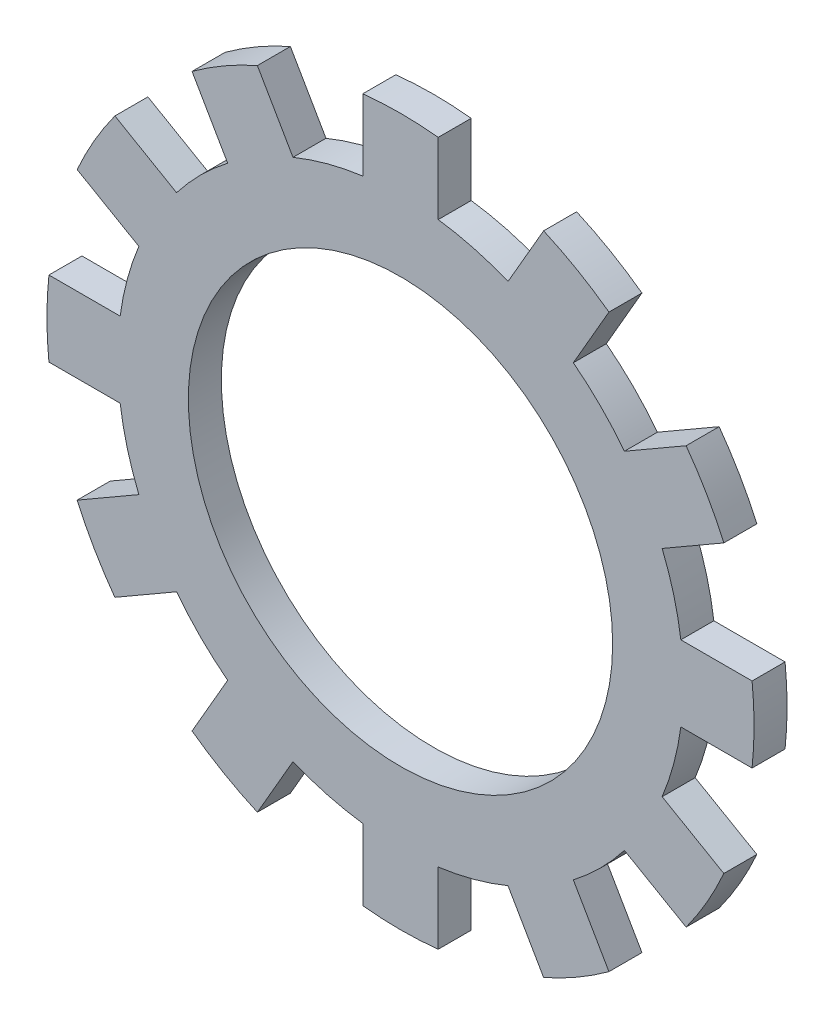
ISO-10303-21;
HEADER;
FILE_DESCRIPTION(('STEP AP214'),'2;1');
FILE_NAME('part.step','',(''),(''),'','','');
FILE_SCHEMA(('AUTOMOTIVE_DESIGN { 1 0 10303 214 1 1 1 1 }'));
ENDSEC;
DATA;
#1=APPLICATION_CONTEXT('core data for automotive mechanical design processes');
#2=APPLICATION_PROTOCOL_DEFINITION('international standard','automotive_design',2000,#1);
#3=PRODUCT_CONTEXT('',#1,'mechanical');
#4=PRODUCT('Part','Part','',(#3));
#5=PRODUCT_RELATED_PRODUCT_CATEGORY('part','',(#4));
#6=PRODUCT_DEFINITION_FORMATION('','',#4);
#7=PRODUCT_DEFINITION_CONTEXT('part definition',#1,'design');
#8=PRODUCT_DEFINITION('design','',#6,#7);
#9=PRODUCT_DEFINITION_SHAPE('','',#8);
#10=(LENGTH_UNIT() NAMED_UNIT(*) SI_UNIT(.MILLI.,.METRE.));
#11=(NAMED_UNIT(*) PLANE_ANGLE_UNIT() SI_UNIT($,.RADIAN.));
#12=(NAMED_UNIT(*) SI_UNIT($,.STERADIAN.) SOLID_ANGLE_UNIT());
#13=UNCERTAINTY_MEASURE_WITH_UNIT(LENGTH_MEASURE(1.E-05),#10,'distance_accuracy_value','');
#14=(GEOMETRIC_REPRESENTATION_CONTEXT(3) GLOBAL_UNCERTAINTY_ASSIGNED_CONTEXT((#13)) GLOBAL_UNIT_ASSIGNED_CONTEXT((#10,
#11,#12)) REPRESENTATION_CONTEXT('',''));
#15=CARTESIAN_POINT('',(0.,0.,0.));
#16=DIRECTION('',(0.,0.,1.));
#17=DIRECTION('',(1.,0.,0.));
#18=AXIS2_PLACEMENT_3D('',#15,#16,#17);
#19=CARTESIAN_POINT('',(0.,0.,0.7));
#20=DIRECTION('',(0.,0.,-1.));
#21=DIRECTION('',(-1.,0.,0.));
#22=AXIS2_PLACEMENT_3D('',#19,#20,#21);
#23=CYLINDRICAL_SURFACE('',#22,12.);
#24=CARTESIAN_POINT('',(0.,0.,-0.7));
#25=DIRECTION('',(0.,0.,1.));
#26=DIRECTION('',(1.,0.,0.));
#27=AXIS2_PLACEMENT_3D('',#24,#25,#26);
#28=CIRCLE('',#27,12.);
#29=CARTESIAN_POINT('',(9.4995145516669,7.33206814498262,-0.7));
#30=VERTEX_POINT('',#29);
#31=CARTESIAN_POINT('',(7.33206814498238,9.49951455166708,-0.7));
#32=VERTEX_POINT('',#31);
#33=EDGE_CURVE('E361',#30,#32,#28,.T.);
#34=ORIENTED_EDGE('',*,*,#33,.T.);
#35=DIRECTION('',(0.,0.,-1.));
#36=VECTOR('',#35,1.);
#37=CARTESIAN_POINT('',(7.33206814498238,9.49951455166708,0.7));
#38=LINE('',#37,#36);
#39=CARTESIAN_POINT('',(7.33206814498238,9.49951455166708,0.7));
#40=VERTEX_POINT('',#39);
#41=EDGE_CURVE('E352',#40,#32,#38,.T.);
#42=ORIENTED_EDGE('',*,*,#41,.F.);
#43=CARTESIAN_POINT('',(0.,0.,0.7));
#44=DIRECTION('',(0.,0.,1.));
#45=DIRECTION('',(1.,0.,0.));
#46=AXIS2_PLACEMENT_3D('',#43,#44,#45);
#47=CIRCLE('',#46,12.);
#48=CARTESIAN_POINT('',(9.49951455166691,7.33206814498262,0.7));
#49=VERTEX_POINT('',#48);
#50=EDGE_CURVE('E64',#49,#40,#47,.T.);
#51=ORIENTED_EDGE('',*,*,#50,.F.);
#52=DIRECTION('',(0.,0.,-1.));
#53=VECTOR('',#52,1.);
#54=CARTESIAN_POINT('',(9.4995145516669,7.33206814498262,0.7));
#55=LINE('',#54,#53);
#56=EDGE_CURVE('E628',#49,#30,#55,.T.);
#57=ORIENTED_EDGE('',*,*,#56,.T.);
#58=EDGE_LOOP('',(#34,#42,#51,#57));
#59=FACE_BOUND('',#58,.T.);
#60=ADVANCED_FACE('F39',(#59),#23,.T.);
#61=DIRECTION('',(0.,0.,-1.));
#62=VECTOR('',#61,1.);
#63=CARTESIAN_POINT('',(4.56078685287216,11.099514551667,0.7));
#64=LINE('',#63,#62);
#65=CARTESIAN_POINT('',(4.56078685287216,11.099514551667,0.7));
#66=VERTEX_POINT('',#65);
#67=CARTESIAN_POINT('',(4.56078685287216,11.099514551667,-0.7));
#68=VERTEX_POINT('',#67);
#69=EDGE_CURVE('E647',#66,#68,#64,.T.);
#70=ORIENTED_EDGE('',*,*,#69,.T.);
#71=CARTESIAN_POINT('',(1.6,11.8928549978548,-0.7));
#72=VERTEX_POINT('',#71);
#73=EDGE_CURVE('E388',#68,#72,#28,.T.);
#74=ORIENTED_EDGE('',*,*,#73,.T.);
#75=DIRECTION('',(0.,0.,-1.));
#76=VECTOR('',#75,1.);
#77=CARTESIAN_POINT('',(1.6,11.8928549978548,0.7));
#78=LINE('',#77,#76);
#79=CARTESIAN_POINT('',(1.6,11.8928549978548,0.7));
#80=VERTEX_POINT('',#79);
#81=EDGE_CURVE('E405',#80,#72,#78,.T.);
#82=ORIENTED_EDGE('',*,*,#81,.F.);
#83=EDGE_CURVE('E50',#66,#80,#47,.T.);
#84=ORIENTED_EDGE('',*,*,#83,.F.);
#85=EDGE_LOOP('',(#70,#74,#82,#84));
#86=FACE_BOUND('',#85,.T.);
#87=ADVANCED_FACE('F817',(#86),#23,.T.);
#88=CARTESIAN_POINT('',(11.8928549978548,1.60000000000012,-0.7));
#89=VERTEX_POINT('',#88);
#90=CARTESIAN_POINT('',(11.0995145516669,4.56078685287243,-0.7));
#91=VERTEX_POINT('',#90);
#92=EDGE_CURVE('E908',#89,#91,#28,.T.);
#93=ORIENTED_EDGE('',*,*,#92,.T.);
#94=DIRECTION('',(0.,0.,-1.));
#95=VECTOR('',#94,1.);
#96=CARTESIAN_POINT('',(11.0995145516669,4.56078685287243,0.7));
#97=LINE('',#96,#95);
#98=CARTESIAN_POINT('',(11.0995145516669,4.56078685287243,0.7));
#99=VERTEX_POINT('',#98);
#100=EDGE_CURVE('E786',#99,#91,#97,.T.);
#101=ORIENTED_EDGE('',*,*,#100,.F.);
#102=CARTESIAN_POINT('',(11.8928549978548,1.60000000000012,0.7));
#103=VERTEX_POINT('',#102);
#104=EDGE_CURVE('E371',#103,#99,#47,.T.);
#105=ORIENTED_EDGE('',*,*,#104,.F.);
#106=DIRECTION('',(0.,0.,-1.));
#107=VECTOR('',#106,1.);
#108=CARTESIAN_POINT('',(11.8928549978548,1.60000000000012,0.7));
#109=LINE('',#108,#107);
#110=EDGE_CURVE('E606',#103,#89,#109,.T.);
#111=ORIENTED_EDGE('',*,*,#110,.T.);
#112=EDGE_LOOP('',(#93,#101,#105,#111));
#113=FACE_BOUND('',#112,.T.);
#114=ADVANCED_FACE('F906',(#113),#23,.T.);
#115=CARTESIAN_POINT('',(11.099514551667,-4.5607868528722,-0.7));
#116=VERTEX_POINT('',#115);
#117=CARTESIAN_POINT('',(11.8928549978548,-1.59999999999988,-0.7));
#118=VERTEX_POINT('',#117);
#119=EDGE_CURVE('E889',#116,#118,#28,.T.);
#120=ORIENTED_EDGE('',*,*,#119,.T.);
#121=DIRECTION('',(0.,0.,-1.));
#122=VECTOR('',#121,1.);
#123=CARTESIAN_POINT('',(11.8928549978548,-1.59999999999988,0.7));
#124=LINE('',#123,#122);
#125=CARTESIAN_POINT('',(11.8928549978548,-1.59999999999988,0.7));
#126=VERTEX_POINT('',#125);
#127=EDGE_CURVE('E772',#126,#118,#124,.T.);
#128=ORIENTED_EDGE('',*,*,#127,.F.);
#129=CARTESIAN_POINT('',(11.099514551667,-4.5607868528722,0.7));
#130=VERTEX_POINT('',#129);
#131=EDGE_CURVE('E376',#130,#126,#47,.T.);
#132=ORIENTED_EDGE('',*,*,#131,.F.);
#133=DIRECTION('',(0.,0.,-1.));
#134=VECTOR('',#133,1.);
#135=CARTESIAN_POINT('',(11.099514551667,-4.5607868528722,0.7));
#136=LINE('',#135,#134);
#137=EDGE_CURVE('E584',#130,#116,#136,.T.);
#138=ORIENTED_EDGE('',*,*,#137,.T.);
#139=EDGE_LOOP('',(#120,#128,#132,#138));
#140=FACE_BOUND('',#139,.T.);
#141=ADVANCED_FACE('F888',(#140),#23,.T.);
#142=CARTESIAN_POINT('',(7.33206814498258,-9.49951455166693,-0.7));
#143=VERTEX_POINT('',#142);
#144=CARTESIAN_POINT('',(9.49951455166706,-7.33206814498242,-0.7));
#145=VERTEX_POINT('',#144);
#146=EDGE_CURVE('E966',#143,#145,#28,.T.);
#147=ORIENTED_EDGE('',*,*,#146,.T.);
#148=DIRECTION('',(0.,0.,-1.));
#149=VECTOR('',#148,1.);
#150=CARTESIAN_POINT('',(9.49951455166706,-7.33206814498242,0.7));
#151=LINE('',#150,#149);
#152=CARTESIAN_POINT('',(9.49951455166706,-7.33206814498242,0.7));
#153=VERTEX_POINT('',#152);
#154=EDGE_CURVE('E758',#153,#145,#151,.T.);
#155=ORIENTED_EDGE('',*,*,#154,.F.);
#156=CARTESIAN_POINT('',(7.33206814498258,-9.49951455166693,0.7));
#157=VERTEX_POINT('',#156);
#158=EDGE_CURVE('E873',#157,#153,#47,.T.);
#159=ORIENTED_EDGE('',*,*,#158,.F.);
#160=DIRECTION('',(0.,0.,-1.));
#161=VECTOR('',#160,1.);
#162=CARTESIAN_POINT('',(7.33206814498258,-9.49951455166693,0.7));
#163=LINE('',#162,#161);
#164=EDGE_CURVE('E562',#157,#143,#163,.T.);
#165=ORIENTED_EDGE('',*,*,#164,.T.);
#166=EDGE_LOOP('',(#147,#155,#159,#165));
#167=FACE_BOUND('',#166,.T.);
#168=ADVANCED_FACE('F974',(#167),#23,.T.);
#169=CARTESIAN_POINT('',(1.6,-11.8928549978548,-0.7));
#170=VERTEX_POINT('',#169);
#171=CARTESIAN_POINT('',(4.56078685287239,-11.099514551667,-0.7));
#172=VERTEX_POINT('',#171);
#173=EDGE_CURVE('E962',#170,#172,#28,.T.);
#174=ORIENTED_EDGE('',*,*,#173,.T.);
#175=DIRECTION('',(0.,0.,-1.));
#176=VECTOR('',#175,1.);
#177=CARTESIAN_POINT('',(4.56078685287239,-11.099514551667,0.7));
#178=LINE('',#177,#176);
#179=CARTESIAN_POINT('',(4.56078685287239,-11.099514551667,0.7));
#180=VERTEX_POINT('',#179);
#181=EDGE_CURVE('E744',#180,#172,#178,.T.);
#182=ORIENTED_EDGE('',*,*,#181,.F.);
#183=CARTESIAN_POINT('',(1.6,-11.8928549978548,0.7));
#184=VERTEX_POINT('',#183);
#185=EDGE_CURVE('E869',#184,#180,#47,.T.);
#186=ORIENTED_EDGE('',*,*,#185,.F.);
#187=DIRECTION('',(0.,0.,-1.));
#188=VECTOR('',#187,1.);
#189=CARTESIAN_POINT('',(1.6,-11.8928549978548,0.7));
#190=LINE('',#189,#188);
#191=EDGE_CURVE('E540',#184,#170,#190,.T.);
#192=ORIENTED_EDGE('',*,*,#191,.T.);
#193=EDGE_LOOP('',(#174,#182,#186,#192));
#194=FACE_BOUND('',#193,.T.);
#195=ADVANCED_FACE('F1402',(#194),#23,.T.);
#196=CARTESIAN_POINT('',(-4.56078685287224,-11.099514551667,-0.7));
#197=VERTEX_POINT('',#196);
#198=CARTESIAN_POINT('',(-1.6,-11.8928549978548,-0.7));
#199=VERTEX_POINT('',#198);
#200=EDGE_CURVE('E957',#197,#199,#28,.T.);
#201=ORIENTED_EDGE('',*,*,#200,.T.);
#202=DIRECTION('',(0.,0.,-1.));
#203=VECTOR('',#202,1.);
#204=CARTESIAN_POINT('',(-1.6,-11.8928549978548,0.7));
#205=LINE('',#204,#203);
#206=CARTESIAN_POINT('',(-1.6,-11.8928549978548,0.7));
#207=VERTEX_POINT('',#206);
#208=EDGE_CURVE('E730',#207,#199,#205,.T.);
#209=ORIENTED_EDGE('',*,*,#208,.F.);
#210=CARTESIAN_POINT('',(-4.56078685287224,-11.099514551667,0.7));
#211=VERTEX_POINT('',#210);
#212=EDGE_CURVE('E865',#211,#207,#47,.T.);
#213=ORIENTED_EDGE('',*,*,#212,.F.);
#214=DIRECTION('',(0.,0.,-1.));
#215=VECTOR('',#214,1.);
#216=CARTESIAN_POINT('',(-4.56078685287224,-11.099514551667,0.7));
#217=LINE('',#216,#215);
#218=EDGE_CURVE('E518',#211,#197,#217,.T.);
#219=ORIENTED_EDGE('',*,*,#218,.T.);
#220=EDGE_LOOP('',(#201,#209,#213,#219));
#221=FACE_BOUND('',#220,.T.);
#222=ADVANCED_FACE('F1394',(#221),#23,.T.);
#223=CARTESIAN_POINT('',(-9.49951455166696,-7.33206814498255,-0.7));
#224=VERTEX_POINT('',#223);
#225=CARTESIAN_POINT('',(-7.33206814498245,-9.49951455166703,-0.7));
#226=VERTEX_POINT('',#225);
#227=EDGE_CURVE('E953',#224,#226,#28,.T.);
#228=ORIENTED_EDGE('',*,*,#227,.T.);
#229=DIRECTION('',(0.,0.,-1.));
#230=VECTOR('',#229,1.);
#231=CARTESIAN_POINT('',(-7.33206814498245,-9.49951455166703,0.7));
#232=LINE('',#231,#230);
#233=CARTESIAN_POINT('',(-7.33206814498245,-9.49951455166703,0.7));
#234=VERTEX_POINT('',#233);
#235=EDGE_CURVE('E716',#234,#226,#232,.T.);
#236=ORIENTED_EDGE('',*,*,#235,.F.);
#237=CARTESIAN_POINT('',(-9.49951455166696,-7.33206814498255,0.7));
#238=VERTEX_POINT('',#237);
#239=EDGE_CURVE('E860',#238,#234,#47,.T.);
#240=ORIENTED_EDGE('',*,*,#239,.F.);
#241=DIRECTION('',(0.,0.,-1.));
#242=VECTOR('',#241,1.);
#243=CARTESIAN_POINT('',(-9.49951455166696,-7.33206814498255,0.7));
#244=LINE('',#243,#242);
#245=EDGE_CURVE('E496',#238,#224,#244,.T.);
#246=ORIENTED_EDGE('',*,*,#245,.T.);
#247=EDGE_LOOP('',(#228,#236,#240,#246));
#248=FACE_BOUND('',#247,.T.);
#249=ADVANCED_FACE('F1386',(#248),#23,.T.);
#250=CARTESIAN_POINT('',(-11.8928549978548,-1.60000000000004,-0.7));
#251=VERTEX_POINT('',#250);
#252=CARTESIAN_POINT('',(-11.099514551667,-4.56078685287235,-0.7));
#253=VERTEX_POINT('',#252);
#254=EDGE_CURVE('E950',#251,#253,#28,.T.);
#255=ORIENTED_EDGE('',*,*,#254,.T.);
#256=DIRECTION('',(0.,0.,-1.));
#257=VECTOR('',#256,1.);
#258=CARTESIAN_POINT('',(-11.099514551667,-4.56078685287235,0.7));
#259=LINE('',#258,#257);
#260=CARTESIAN_POINT('',(-11.099514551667,-4.56078685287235,0.7));
#261=VERTEX_POINT('',#260);
#262=EDGE_CURVE('E703',#261,#253,#259,.T.);
#263=ORIENTED_EDGE('',*,*,#262,.F.);
#264=CARTESIAN_POINT('',(-11.8928549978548,-1.60000000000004,0.7));
#265=VERTEX_POINT('',#264);
#266=EDGE_CURVE('E855',#265,#261,#47,.T.);
#267=ORIENTED_EDGE('',*,*,#266,.F.);
#268=DIRECTION('',(0.,0.,-1.));
#269=VECTOR('',#268,1.);
#270=CARTESIAN_POINT('',(-11.8928549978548,-1.60000000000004,0.7));
#271=LINE('',#270,#269);
#272=EDGE_CURVE('E474',#265,#251,#271,.T.);
#273=ORIENTED_EDGE('',*,*,#272,.T.);
#274=EDGE_LOOP('',(#255,#263,#267,#273));
#275=FACE_BOUND('',#274,.T.);
#276=ADVANCED_FACE('F941',(#275),#23,.T.);
#277=CARTESIAN_POINT('',(-11.099514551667,4.56078685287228,-0.7));
#278=VERTEX_POINT('',#277);
#279=CARTESIAN_POINT('',(-11.8928549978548,1.59999999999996,-0.7));
#280=VERTEX_POINT('',#279);
#281=EDGE_CURVE('E946',#278,#280,#28,.T.);
#282=ORIENTED_EDGE('',*,*,#281,.T.);
#283=DIRECTION('',(0.,0.,-1.));
#284=VECTOR('',#283,1.);
#285=CARTESIAN_POINT('',(-11.8928549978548,1.59999999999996,0.7));
#286=LINE('',#285,#284);
#287=CARTESIAN_POINT('',(-11.8928549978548,1.59999999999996,0.7));
#288=VERTEX_POINT('',#287);
#289=EDGE_CURVE('E689',#288,#280,#286,.T.);
#290=ORIENTED_EDGE('',*,*,#289,.F.);
#291=CARTESIAN_POINT('',(-11.099514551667,4.56078685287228,0.7));
#292=VERTEX_POINT('',#291);
#293=EDGE_CURVE('E852',#292,#288,#47,.T.);
#294=ORIENTED_EDGE('',*,*,#293,.F.);
#295=DIRECTION('',(0.,0.,-1.));
#296=VECTOR('',#295,1.);
#297=CARTESIAN_POINT('',(-11.099514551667,4.56078685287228,0.7));
#298=LINE('',#297,#296);
#299=EDGE_CURVE('E452',#292,#278,#298,.T.);
#300=ORIENTED_EDGE('',*,*,#299,.T.);
#301=EDGE_LOOP('',(#282,#290,#294,#300));
#302=FACE_BOUND('',#301,.T.);
#303=ADVANCED_FACE('F937',(#302),#23,.T.);
#304=CARTESIAN_POINT('',(-7.33206814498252,9.49951455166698,-0.7));
#305=VERTEX_POINT('',#304);
#306=CARTESIAN_POINT('',(-9.49951455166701,7.33206814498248,-0.7));
#307=VERTEX_POINT('',#306);
#308=EDGE_CURVE('E944',#305,#307,#28,.T.);
#309=ORIENTED_EDGE('',*,*,#308,.T.);
#310=DIRECTION('',(0.,0.,-1.));
#311=VECTOR('',#310,1.);
#312=CARTESIAN_POINT('',(-9.49951455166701,7.33206814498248,0.7));
#313=LINE('',#312,#311);
#314=CARTESIAN_POINT('',(-9.49951455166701,7.33206814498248,0.7));
#315=VERTEX_POINT('',#314);
#316=EDGE_CURVE('E675',#315,#307,#313,.T.);
#317=ORIENTED_EDGE('',*,*,#316,.F.);
#318=CARTESIAN_POINT('',(-7.33206814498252,9.49951455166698,0.7));
#319=VERTEX_POINT('',#318);
#320=EDGE_CURVE('E49',#319,#315,#47,.T.);
#321=ORIENTED_EDGE('',*,*,#320,.F.);
#322=DIRECTION('',(0.,0.,-1.));
#323=VECTOR('',#322,1.);
#324=CARTESIAN_POINT('',(-7.33206814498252,9.49951455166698,0.7));
#325=LINE('',#324,#323);
#326=EDGE_CURVE('E430',#319,#305,#325,.T.);
#327=ORIENTED_EDGE('',*,*,#326,.T.);
#328=EDGE_LOOP('',(#309,#317,#321,#327));
#329=FACE_BOUND('',#328,.T.);
#330=ADVANCED_FACE('F931',(#329),#23,.T.);
#331=CARTESIAN_POINT('',(-1.6,11.8928549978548,-0.7));
#332=VERTEX_POINT('',#331);
#333=CARTESIAN_POINT('',(-4.56078685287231,11.099514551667,-0.7));
#334=VERTEX_POINT('',#333);
#335=EDGE_CURVE('E43',#332,#334,#28,.T.);
#336=ORIENTED_EDGE('',*,*,#335,.T.);
#337=DIRECTION('',(0.,0.,-1.));
#338=VECTOR('',#337,1.);
#339=CARTESIAN_POINT('',(-4.56078685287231,11.099514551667,0.7));
#340=LINE('',#339,#338);
#341=CARTESIAN_POINT('',(-4.56078685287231,11.099514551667,0.7));
#342=VERTEX_POINT('',#341);
#343=EDGE_CURVE('E659',#342,#334,#340,.T.);
#344=ORIENTED_EDGE('',*,*,#343,.F.);
#345=CARTESIAN_POINT('',(-1.6,11.8928549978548,0.7));
#346=VERTEX_POINT('',#345);
#347=EDGE_CURVE('E11',#346,#342,#47,.T.);
#348=ORIENTED_EDGE('',*,*,#347,.F.);
#349=DIRECTION('',(0.,0.,-1.));
#350=VECTOR('',#349,1.);
#351=CARTESIAN_POINT('',(-1.6,11.8928549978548,0.7));
#352=LINE('',#351,#350);
#353=EDGE_CURVE('E392',#346,#332,#352,.T.);
#354=ORIENTED_EDGE('',*,*,#353,.T.);
#355=EDGE_LOOP('',(#336,#344,#348,#354));
#356=FACE_BOUND('',#355,.T.);
#357=ADVANCED_FACE('F41',(#356),#23,.T.);
#358=CARTESIAN_POINT('',(0.,0.,0.7));
#359=DIRECTION('',(0.,0.,1.));
#360=DIRECTION('',(1.,0.,0.));
#361=AXIS2_PLACEMENT_3D('',#358,#359,#360);
#362=PLANE('',#361);
#363=ORIENTED_EDGE('',*,*,#347,.T.);
#364=DIRECTION('',(0.500000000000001,-0.866025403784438,0.));
#365=VECTOR('',#364,1.);
#366=CARTESIAN_POINT('',(-6.07157062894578,13.716268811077,0.7));
#367=LINE('',#366,#365);
#368=CARTESIAN_POINT('',(-6.07157062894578,13.716268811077,0.7));
#369=VERTEX_POINT('',#368);
#370=EDGE_CURVE('E670',#369,#342,#367,.T.);
#371=ORIENTED_EDGE('',*,*,#370,.F.);
#372=CARTESIAN_POINT('',(0.,0.,0.7));
#373=DIRECTION('',(0.,0.,1.));
#374=DIRECTION('',(0.866025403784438,0.500000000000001,0.));
#375=AXIS2_PLACEMENT_3D('',#372,#373,#374);
#376=CIRCLE('',#375,15.);
#377=CARTESIAN_POINT('',(-8.84285192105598,12.116268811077,0.7));
#378=VERTEX_POINT('',#377);
#379=EDGE_CURVE('E439',#369,#378,#376,.T.);
#380=ORIENTED_EDGE('',*,*,#379,.T.);
#381=DIRECTION('',(0.500000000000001,-0.866025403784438,0.));
#382=VECTOR('',#381,1.);
#383=CARTESIAN_POINT('',(-8.84285192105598,12.116268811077,0.7));
#384=LINE('',#383,#382);
#385=EDGE_CURVE('E434',#378,#319,#384,.T.);
#386=ORIENTED_EDGE('',*,*,#385,.T.);
#387=ORIENTED_EDGE('',*,*,#320,.T.);
#388=DIRECTION('',(0.86602540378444,-0.499999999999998,0.));
#389=VECTOR('',#388,1.);
#390=CARTESIAN_POINT('',(-12.116268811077,8.84285192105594,0.7));
#391=LINE('',#390,#389);
#392=CARTESIAN_POINT('',(-12.116268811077,8.84285192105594,0.7));
#393=VERTEX_POINT('',#392);
#394=EDGE_CURVE('E684',#393,#315,#391,.T.);
#395=ORIENTED_EDGE('',*,*,#394,.F.);
#396=CARTESIAN_POINT('',(0.,0.,0.7));
#397=DIRECTION('',(0.,0.,1.));
#398=DIRECTION('',(0.499999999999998,0.86602540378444,0.));
#399=AXIS2_PLACEMENT_3D('',#396,#397,#398);
#400=CIRCLE('',#399,15.);
#401=CARTESIAN_POINT('',(-13.716268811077,6.07157062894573,0.7));
#402=VERTEX_POINT('',#401);
#403=EDGE_CURVE('E461',#393,#402,#400,.T.);
#404=ORIENTED_EDGE('',*,*,#403,.T.);
#405=DIRECTION('',(0.86602540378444,-0.499999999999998,0.));
#406=VECTOR('',#405,1.);
#407=CARTESIAN_POINT('',(-13.716268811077,6.07157062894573,0.7));
#408=LINE('',#407,#406);
#409=EDGE_CURVE('E456',#402,#292,#408,.T.);
#410=ORIENTED_EDGE('',*,*,#409,.T.);
#411=ORIENTED_EDGE('',*,*,#293,.T.);
#412=DIRECTION('',(1.,0.,0.));
#413=VECTOR('',#412,1.);
#414=CARTESIAN_POINT('',(-14.9144225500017,1.59999999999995,0.7));
#415=LINE('',#414,#413);
#416=CARTESIAN_POINT('',(-14.9144225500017,1.59999999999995,0.7));
#417=VERTEX_POINT('',#416);
#418=EDGE_CURVE('E698',#417,#288,#415,.T.);
#419=ORIENTED_EDGE('',*,*,#418,.F.);
#420=CARTESIAN_POINT('',(0.,0.,0.7));
#421=DIRECTION('',(0.,0.,1.));
#422=DIRECTION('',(0.,1.,0.));
#423=AXIS2_PLACEMENT_3D('',#420,#421,#422);
#424=CIRCLE('',#423,15.);
#425=CARTESIAN_POINT('',(-14.9144225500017,-1.60000000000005,0.7));
#426=VERTEX_POINT('',#425);
#427=EDGE_CURVE('E483',#417,#426,#424,.T.);
#428=ORIENTED_EDGE('',*,*,#427,.T.);
#429=DIRECTION('',(1.,0.,0.));
#430=VECTOR('',#429,1.);
#431=CARTESIAN_POINT('',(-14.9144225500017,-1.60000000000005,0.7));
#432=LINE('',#431,#430);
#433=EDGE_CURVE('E478',#426,#265,#432,.T.);
#434=ORIENTED_EDGE('',*,*,#433,.T.);
#435=ORIENTED_EDGE('',*,*,#266,.T.);
#436=DIRECTION('',(0.866025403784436,0.500000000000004,0.));
#437=VECTOR('',#436,1.);
#438=CARTESIAN_POINT('',(-13.716268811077,-6.07157062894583,0.7));
#439=LINE('',#438,#437);
#440=CARTESIAN_POINT('',(-13.716268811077,-6.07157062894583,0.7));
#441=VERTEX_POINT('',#440);
#442=EDGE_CURVE('E711',#441,#261,#439,.T.);
#443=ORIENTED_EDGE('',*,*,#442,.F.);
#444=CARTESIAN_POINT('',(0.,0.,0.7));
#445=DIRECTION('',(0.,0.,1.));
#446=DIRECTION('',(-0.500000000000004,0.866025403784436,0.));
#447=AXIS2_PLACEMENT_3D('',#444,#445,#446);
#448=CIRCLE('',#447,15.);
#449=CARTESIAN_POINT('',(-12.1162688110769,-8.84285192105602,0.7));
#450=VERTEX_POINT('',#449);
#451=EDGE_CURVE('E505',#441,#450,#448,.T.);
#452=ORIENTED_EDGE('',*,*,#451,.T.);
#453=DIRECTION('',(0.866025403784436,0.500000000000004,0.));
#454=VECTOR('',#453,1.);
#455=CARTESIAN_POINT('',(-12.1162688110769,-8.84285192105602,0.7));
#456=LINE('',#455,#454);
#457=EDGE_CURVE('E500',#450,#238,#456,.T.);
#458=ORIENTED_EDGE('',*,*,#457,.T.);
#459=ORIENTED_EDGE('',*,*,#239,.T.);
#460=DIRECTION('',(0.499999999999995,0.866025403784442,0.));
#461=VECTOR('',#460,1.);
#462=CARTESIAN_POINT('',(-8.84285192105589,-12.116268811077,0.7));
#463=LINE('',#462,#461);
#464=CARTESIAN_POINT('',(-8.8428519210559,-12.116268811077,0.7));
#465=VERTEX_POINT('',#464);
#466=EDGE_CURVE('E725',#465,#234,#463,.T.);
#467=ORIENTED_EDGE('',*,*,#466,.F.);
#468=CARTESIAN_POINT('',(0.,0.,0.7));
#469=DIRECTION('',(0.,0.,1.));
#470=DIRECTION('',(-0.866025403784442,0.499999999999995,0.));
#471=AXIS2_PLACEMENT_3D('',#468,#469,#470);
#472=CIRCLE('',#471,15.);
#473=CARTESIAN_POINT('',(-6.07157062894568,-13.716268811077,0.7));
#474=VERTEX_POINT('',#473);
#475=EDGE_CURVE('E527',#465,#474,#472,.T.);
#476=ORIENTED_EDGE('',*,*,#475,.T.);
#477=DIRECTION('',(0.499999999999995,0.866025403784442,0.));
#478=VECTOR('',#477,1.);
#479=CARTESIAN_POINT('',(-6.07157062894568,-13.716268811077,0.7));
#480=LINE('',#479,#478);
#481=EDGE_CURVE('E522',#474,#211,#480,.T.);
#482=ORIENTED_EDGE('',*,*,#481,.T.);
#483=ORIENTED_EDGE('',*,*,#212,.T.);
#484=DIRECTION('',(0.,1.,0.));
#485=VECTOR('',#484,1.);
#486=CARTESIAN_POINT('',(-1.6,-14.9144225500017,0.7));
#487=LINE('',#486,#485);
#488=CARTESIAN_POINT('',(-1.6,-14.9144225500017,0.7));
#489=VERTEX_POINT('',#488);
#490=EDGE_CURVE('E739',#489,#207,#487,.T.);
#491=ORIENTED_EDGE('',*,*,#490,.F.);
#492=CARTESIAN_POINT('',(0.,0.,0.7));
#493=DIRECTION('',(0.,0.,1.));
#494=DIRECTION('',(-1.,0.,0.));
#495=AXIS2_PLACEMENT_3D('',#492,#493,#494);
#496=CIRCLE('',#495,15.);
#497=CARTESIAN_POINT('',(1.6,-14.9144225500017,0.7));
#498=VERTEX_POINT('',#497);
#499=EDGE_CURVE('E549',#489,#498,#496,.T.);
#500=ORIENTED_EDGE('',*,*,#499,.T.);
#501=DIRECTION('',(0.,1.,0.));
#502=VECTOR('',#501,1.);
#503=CARTESIAN_POINT('',(1.6,-14.9144225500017,0.7));
#504=LINE('',#503,#502);
#505=EDGE_CURVE('E544',#498,#184,#504,.T.);
#506=ORIENTED_EDGE('',*,*,#505,.T.);
#507=ORIENTED_EDGE('',*,*,#185,.T.);
#508=DIRECTION('',(-0.500000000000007,0.866025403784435,0.));
#509=VECTOR('',#508,1.);
#510=CARTESIAN_POINT('',(6.07157062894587,-13.7162688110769,0.7));
#511=LINE('',#510,#509);
#512=CARTESIAN_POINT('',(6.07157062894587,-13.7162688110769,0.7));
#513=VERTEX_POINT('',#512);
#514=EDGE_CURVE('E753',#513,#180,#511,.T.);
#515=ORIENTED_EDGE('',*,*,#514,.F.);
#516=CARTESIAN_POINT('',(0.,0.,0.7));
#517=DIRECTION('',(0.,0.,1.));
#518=DIRECTION('',(-0.866025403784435,-0.500000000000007,0.));
#519=AXIS2_PLACEMENT_3D('',#516,#517,#518);
#520=CIRCLE('',#519,15.);
#521=CARTESIAN_POINT('',(8.84285192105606,-12.1162688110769,0.7));
#522=VERTEX_POINT('',#521);
#523=EDGE_CURVE('E571',#513,#522,#520,.T.);
#524=ORIENTED_EDGE('',*,*,#523,.T.);
#525=DIRECTION('',(-0.500000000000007,0.866025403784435,0.));
#526=VECTOR('',#525,1.);
#527=CARTESIAN_POINT('',(8.84285192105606,-12.1162688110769,0.7));
#528=LINE('',#527,#526);
#529=EDGE_CURVE('E566',#522,#157,#528,.T.);
#530=ORIENTED_EDGE('',*,*,#529,.T.);
#531=ORIENTED_EDGE('',*,*,#158,.T.);
#532=DIRECTION('',(-0.866025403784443,0.499999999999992,0.));
#533=VECTOR('',#532,1.);
#534=CARTESIAN_POINT('',(12.1162688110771,-8.84285192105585,0.7));
#535=LINE('',#534,#533);
#536=CARTESIAN_POINT('',(12.1162688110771,-8.84285192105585,0.7));
#537=VERTEX_POINT('',#536);
#538=EDGE_CURVE('E767',#537,#153,#535,.T.);
#539=ORIENTED_EDGE('',*,*,#538,.F.);
#540=CARTESIAN_POINT('',(0.,0.,0.7));
#541=DIRECTION('',(0.,0.,1.));
#542=DIRECTION('',(-0.499999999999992,-0.866025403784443,0.));
#543=AXIS2_PLACEMENT_3D('',#540,#541,#542);
#544=CIRCLE('',#543,15.);
#545=CARTESIAN_POINT('',(13.716268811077,-6.07157062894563,0.7));
#546=VERTEX_POINT('',#545);
#547=EDGE_CURVE('E593',#537,#546,#544,.T.);
#548=ORIENTED_EDGE('',*,*,#547,.T.);
#549=DIRECTION('',(-0.866025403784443,0.499999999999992,0.));
#550=VECTOR('',#549,1.);
#551=CARTESIAN_POINT('',(13.716268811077,-6.07157062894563,0.7));
#552=LINE('',#551,#550);
#553=EDGE_CURVE('E588',#546,#130,#552,.T.);
#554=ORIENTED_EDGE('',*,*,#553,.T.);
#555=ORIENTED_EDGE('',*,*,#131,.T.);
#556=DIRECTION('',(-1.,0.,0.));
#557=VECTOR('',#556,1.);
#558=CARTESIAN_POINT('',(14.9144225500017,-1.59999999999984,0.7));
#559=LINE('',#558,#557);
#560=CARTESIAN_POINT('',(14.9144225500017,-1.59999999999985,0.7));
#561=VERTEX_POINT('',#560);
#562=EDGE_CURVE('E781',#561,#126,#559,.T.);
#563=ORIENTED_EDGE('',*,*,#562,.F.);
#564=CARTESIAN_POINT('',(0.,0.,0.7));
#565=DIRECTION('',(0.,0.,1.));
#566=DIRECTION('',(0.,-1.,0.));
#567=AXIS2_PLACEMENT_3D('',#564,#565,#566);
#568=CIRCLE('',#567,15.);
#569=CARTESIAN_POINT('',(14.9144225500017,1.60000000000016,0.7));
#570=VERTEX_POINT('',#569);
#571=EDGE_CURVE('E615',#561,#570,#568,.T.);
#572=ORIENTED_EDGE('',*,*,#571,.T.);
#573=DIRECTION('',(-1.,0.,0.));
#574=VECTOR('',#573,1.);
#575=CARTESIAN_POINT('',(14.9144225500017,1.60000000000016,0.7));
#576=LINE('',#575,#574);
#577=EDGE_CURVE('E610',#570,#103,#576,.T.);
#578=ORIENTED_EDGE('',*,*,#577,.T.);
#579=ORIENTED_EDGE('',*,*,#104,.T.);
#580=DIRECTION('',(-0.866025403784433,-0.50000000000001,0.));
#581=VECTOR('',#580,1.);
#582=CARTESIAN_POINT('',(13.7162688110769,6.07157062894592,0.7));
#583=LINE('',#582,#581);
#584=CARTESIAN_POINT('',(13.7162688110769,6.07157062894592,0.7));
#585=VERTEX_POINT('',#584);
#586=EDGE_CURVE('E795',#585,#99,#583,.T.);
#587=ORIENTED_EDGE('',*,*,#586,.F.);
#588=CARTESIAN_POINT('',(0.,0.,0.7));
#589=DIRECTION('',(0.,0.,1.));
#590=DIRECTION('',(0.50000000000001,-0.866025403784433,0.));
#591=AXIS2_PLACEMENT_3D('',#588,#589,#590);
#592=CIRCLE('',#591,15.);
#593=CARTESIAN_POINT('',(12.1162688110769,8.84285192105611,0.7));
#594=VERTEX_POINT('',#593);
#595=EDGE_CURVE('E635',#585,#594,#592,.T.);
#596=ORIENTED_EDGE('',*,*,#595,.T.);
#597=DIRECTION('',(-0.866025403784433,-0.50000000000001,0.));
#598=VECTOR('',#597,1.);
#599=CARTESIAN_POINT('',(12.1162688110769,8.84285192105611,0.7));
#600=LINE('',#599,#598);
#601=EDGE_CURVE('E368',#594,#49,#600,.T.);
#602=ORIENTED_EDGE('',*,*,#601,.T.);
#603=ORIENTED_EDGE('',*,*,#50,.T.);
#604=DIRECTION('',(-0.499999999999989,-0.866025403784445,0.));
#605=VECTOR('',#604,1.);
#606=CARTESIAN_POINT('',(8.84285192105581,12.1162688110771,0.7));
#607=LINE('',#606,#605);
#608=CARTESIAN_POINT('',(8.84285192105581,12.1162688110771,0.7));
#609=VERTEX_POINT('',#608);
#610=EDGE_CURVE('E349',#609,#40,#607,.T.);
#611=ORIENTED_EDGE('',*,*,#610,.F.);
#612=CARTESIAN_POINT('',(0.,0.,0.7));
#613=DIRECTION('',(0.,0.,1.));
#614=DIRECTION('',(0.866025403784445,-0.499999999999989,0.));
#615=AXIS2_PLACEMENT_3D('',#612,#613,#614);
#616=CIRCLE('',#615,15.);
#617=CARTESIAN_POINT('',(6.07157062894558,13.7162688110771,0.7));
#618=VERTEX_POINT('',#617);
#619=EDGE_CURVE('E655',#609,#618,#616,.T.);
#620=ORIENTED_EDGE('',*,*,#619,.T.);
#621=DIRECTION('',(-0.499999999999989,-0.866025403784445,0.));
#622=VECTOR('',#621,1.);
#623=CARTESIAN_POINT('',(6.07157062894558,13.7162688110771,0.7));
#624=LINE('',#623,#622);
#625=EDGE_CURVE('E650',#618,#66,#624,.T.);
#626=ORIENTED_EDGE('',*,*,#625,.T.);
#627=ORIENTED_EDGE('',*,*,#83,.T.);
#628=DIRECTION('',(0.,-1.,0.));
#629=VECTOR('',#628,1.);
#630=CARTESIAN_POINT('',(1.6,14.9144225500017,0.7));
#631=LINE('',#630,#629);
#632=CARTESIAN_POINT('',(1.6,14.9144225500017,0.7));
#633=VERTEX_POINT('',#632);
#634=EDGE_CURVE('E418',#633,#80,#631,.T.);
#635=ORIENTED_EDGE('',*,*,#634,.F.);
#636=CARTESIAN_POINT('',(0.,0.,0.7));
#637=DIRECTION('',(0.,0.,1.));
#638=DIRECTION('',(1.,0.,0.));
#639=AXIS2_PLACEMENT_3D('',#636,#637,#638);
#640=CIRCLE('',#639,15.);
#641=CARTESIAN_POINT('',(-1.6,14.9144225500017,0.7));
#642=VERTEX_POINT('',#641);
#643=EDGE_CURVE('E401',#633,#642,#640,.T.);
#644=ORIENTED_EDGE('',*,*,#643,.T.);
#645=DIRECTION('',(0.,-1.,0.));
#646=VECTOR('',#645,1.);
#647=CARTESIAN_POINT('',(-1.6,14.9144225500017,0.7));
#648=LINE('',#647,#646);
#649=EDGE_CURVE('E396',#642,#346,#648,.T.);
#650=ORIENTED_EDGE('',*,*,#649,.T.);
#651=EDGE_LOOP('',(#363,#371,#380,#386,#387,#395,#404,#410,#411,#419,#428,#434,#435,#443,#452,
#458,#459,#467,#476,#482,#483,#491,#500,#506,#507,#515,#524,#530,#531,#539,#548,#554,#555,#563,
#572,#578,#579,#587,#596,#602,#603,#611,#620,#626,#627,#635,#644,#650));
#652=FACE_BOUND('',#651,.T.);
#653=CARTESIAN_POINT('',(0.,0.,0.7));
#654=DIRECTION('',(0.,0.,1.));
#655=DIRECTION('',(1.,0.,0.));
#656=AXIS2_PLACEMENT_3D('',#653,#654,#655);
#657=CIRCLE('',#656,9.);
#658=CARTESIAN_POINT('',(9.,0.,0.7));
#659=VERTEX_POINT('',#658);
#660=EDGE_CURVE('E383',#659,#659,#657,.T.);
#661=ORIENTED_EDGE('',*,*,#660,.F.);
#662=EDGE_LOOP('',(#661));
#663=FACE_BOUND('',#662,.T.);
#664=ADVANCED_FACE('F365',(#652,#663),#362,.T.);
#665=CARTESIAN_POINT('',(0.,0.,-0.7));
#666=DIRECTION('',(0.,0.,1.));
#667=DIRECTION('',(1.,0.,0.));
#668=AXIS2_PLACEMENT_3D('',#665,#666,#667);
#669=PLANE('',#668);
#670=ORIENTED_EDGE('',*,*,#335,.F.);
#671=DIRECTION('',(0.,-1.,0.));
#672=VECTOR('',#671,1.);
#673=CARTESIAN_POINT('',(-1.6,14.9144225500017,-0.7));
#674=LINE('',#673,#672);
#675=CARTESIAN_POINT('',(-1.6,14.9144225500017,-0.7));
#676=VERTEX_POINT('',#675);
#677=EDGE_CURVE('E397',#676,#332,#674,.T.);
#678=ORIENTED_EDGE('',*,*,#677,.F.);
#679=CARTESIAN_POINT('',(0.,0.,-0.7));
#680=DIRECTION('',(0.,0.,1.));
#681=DIRECTION('',(1.,0.,0.));
#682=AXIS2_PLACEMENT_3D('',#679,#680,#681);
#683=CIRCLE('',#682,15.);
#684=CARTESIAN_POINT('',(1.6,14.9144225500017,-0.7));
#685=VERTEX_POINT('',#684);
#686=EDGE_CURVE('E402',#685,#676,#683,.T.);
#687=ORIENTED_EDGE('',*,*,#686,.F.);
#688=DIRECTION('',(0.,-1.,0.));
#689=VECTOR('',#688,1.);
#690=CARTESIAN_POINT('',(1.6,14.9144225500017,-0.7));
#691=LINE('',#690,#689);
#692=EDGE_CURVE('E419',#685,#72,#691,.T.);
#693=ORIENTED_EDGE('',*,*,#692,.T.);
#694=ORIENTED_EDGE('',*,*,#73,.F.);
#695=DIRECTION('',(-0.499999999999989,-0.866025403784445,0.));
#696=VECTOR('',#695,1.);
#697=CARTESIAN_POINT('',(6.07157062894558,13.7162688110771,-0.7));
#698=LINE('',#697,#696);
#699=CARTESIAN_POINT('',(6.07157062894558,13.7162688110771,-0.7));
#700=VERTEX_POINT('',#699);
#701=EDGE_CURVE('E651',#700,#68,#698,.T.);
#702=ORIENTED_EDGE('',*,*,#701,.F.);
#703=CARTESIAN_POINT('',(0.,0.,-0.7));
#704=DIRECTION('',(0.,0.,1.));
#705=DIRECTION('',(0.866025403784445,-0.499999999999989,0.));
#706=AXIS2_PLACEMENT_3D('',#703,#704,#705);
#707=CIRCLE('',#706,15.);
#708=CARTESIAN_POINT('',(8.84285192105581,12.1162688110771,-0.7));
#709=VERTEX_POINT('',#708);
#710=EDGE_CURVE('E656',#709,#700,#707,.T.);
#711=ORIENTED_EDGE('',*,*,#710,.F.);
#712=DIRECTION('',(-0.499999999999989,-0.866025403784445,0.));
#713=VECTOR('',#712,1.);
#714=CARTESIAN_POINT('',(8.84285192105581,12.1162688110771,-0.7));
#715=LINE('',#714,#713);
#716=EDGE_CURVE('E358',#709,#32,#715,.T.);
#717=ORIENTED_EDGE('',*,*,#716,.T.);
#718=ORIENTED_EDGE('',*,*,#33,.F.);
#719=DIRECTION('',(-0.866025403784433,-0.50000000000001,0.));
#720=VECTOR('',#719,1.);
#721=CARTESIAN_POINT('',(12.1162688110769,8.84285192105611,-0.7));
#722=LINE('',#721,#720);
#723=CARTESIAN_POINT('',(12.1162688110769,8.84285192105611,-0.7));
#724=VERTEX_POINT('',#723);
#725=EDGE_CURVE('E631',#724,#30,#722,.T.);
#726=ORIENTED_EDGE('',*,*,#725,.F.);
#727=CARTESIAN_POINT('',(0.,0.,-0.7));
#728=DIRECTION('',(0.,0.,1.));
#729=DIRECTION('',(0.50000000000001,-0.866025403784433,0.));
#730=AXIS2_PLACEMENT_3D('',#727,#728,#729);
#731=CIRCLE('',#730,15.);
#732=CARTESIAN_POINT('',(13.7162688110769,6.07157062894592,-0.7));
#733=VERTEX_POINT('',#732);
#734=EDGE_CURVE('E636',#733,#724,#731,.T.);
#735=ORIENTED_EDGE('',*,*,#734,.F.);
#736=DIRECTION('',(-0.866025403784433,-0.50000000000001,0.));
#737=VECTOR('',#736,1.);
#738=CARTESIAN_POINT('',(13.7162688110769,6.07157062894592,-0.7));
#739=LINE('',#738,#737);
#740=EDGE_CURVE('E363',#733,#91,#739,.T.);
#741=ORIENTED_EDGE('',*,*,#740,.T.);
#742=ORIENTED_EDGE('',*,*,#92,.F.);
#743=DIRECTION('',(-1.,0.,0.));
#744=VECTOR('',#743,1.);
#745=CARTESIAN_POINT('',(14.9144225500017,1.60000000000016,-0.7));
#746=LINE('',#745,#744);
#747=CARTESIAN_POINT('',(14.9144225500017,1.60000000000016,-0.7));
#748=VERTEX_POINT('',#747);
#749=EDGE_CURVE('E611',#748,#89,#746,.T.);
#750=ORIENTED_EDGE('',*,*,#749,.F.);
#751=CARTESIAN_POINT('',(0.,0.,-0.7));
#752=DIRECTION('',(0.,0.,1.));
#753=DIRECTION('',(0.,-1.,0.));
#754=AXIS2_PLACEMENT_3D('',#751,#752,#753);
#755=CIRCLE('',#754,15.);
#756=CARTESIAN_POINT('',(14.9144225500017,-1.59999999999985,-0.7));
#757=VERTEX_POINT('',#756);
#758=EDGE_CURVE('E616',#757,#748,#755,.T.);
#759=ORIENTED_EDGE('',*,*,#758,.F.);
#760=DIRECTION('',(-1.,0.,0.));
#761=VECTOR('',#760,1.);
#762=CARTESIAN_POINT('',(14.9144225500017,-1.59999999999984,-0.7));
#763=LINE('',#762,#761);
#764=EDGE_CURVE('E782',#757,#118,#763,.T.);
#765=ORIENTED_EDGE('',*,*,#764,.T.);
#766=ORIENTED_EDGE('',*,*,#119,.F.);
#767=DIRECTION('',(-0.866025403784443,0.499999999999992,0.));
#768=VECTOR('',#767,1.);
#769=CARTESIAN_POINT('',(13.716268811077,-6.07157062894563,-0.7));
#770=LINE('',#769,#768);
#771=CARTESIAN_POINT('',(13.716268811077,-6.07157062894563,-0.7));
#772=VERTEX_POINT('',#771);
#773=EDGE_CURVE('E589',#772,#116,#770,.T.);
#774=ORIENTED_EDGE('',*,*,#773,.F.);
#775=CARTESIAN_POINT('',(0.,0.,-0.7));
#776=DIRECTION('',(0.,0.,1.));
#777=DIRECTION('',(-0.499999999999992,-0.866025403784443,0.));
#778=AXIS2_PLACEMENT_3D('',#775,#776,#777);
#779=CIRCLE('',#778,15.);
#780=CARTESIAN_POINT('',(12.1162688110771,-8.84285192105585,-0.7));
#781=VERTEX_POINT('',#780);
#782=EDGE_CURVE('E594',#781,#772,#779,.T.);
#783=ORIENTED_EDGE('',*,*,#782,.F.);
#784=DIRECTION('',(-0.866025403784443,0.499999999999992,0.));
#785=VECTOR('',#784,1.);
#786=CARTESIAN_POINT('',(12.1162688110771,-8.84285192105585,-0.7));
#787=LINE('',#786,#785);
#788=EDGE_CURVE('E768',#781,#145,#787,.T.);
#789=ORIENTED_EDGE('',*,*,#788,.T.);
#790=ORIENTED_EDGE('',*,*,#146,.F.);
#791=DIRECTION('',(-0.500000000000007,0.866025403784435,0.));
#792=VECTOR('',#791,1.);
#793=CARTESIAN_POINT('',(8.84285192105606,-12.1162688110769,-0.7));
#794=LINE('',#793,#792);
#795=CARTESIAN_POINT('',(8.84285192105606,-12.1162688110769,-0.7));
#796=VERTEX_POINT('',#795);
#797=EDGE_CURVE('E567',#796,#143,#794,.T.);
#798=ORIENTED_EDGE('',*,*,#797,.F.);
#799=CARTESIAN_POINT('',(0.,0.,-0.7));
#800=DIRECTION('',(0.,0.,1.));
#801=DIRECTION('',(-0.866025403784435,-0.500000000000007,0.));
#802=AXIS2_PLACEMENT_3D('',#799,#800,#801);
#803=CIRCLE('',#802,15.);
#804=CARTESIAN_POINT('',(6.07157062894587,-13.7162688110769,-0.7));
#805=VERTEX_POINT('',#804);
#806=EDGE_CURVE('E572',#805,#796,#803,.T.);
#807=ORIENTED_EDGE('',*,*,#806,.F.);
#808=DIRECTION('',(-0.500000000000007,0.866025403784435,0.));
#809=VECTOR('',#808,1.);
#810=CARTESIAN_POINT('',(6.07157062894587,-13.7162688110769,-0.7));
#811=LINE('',#810,#809);
#812=EDGE_CURVE('E754',#805,#172,#811,.T.);
#813=ORIENTED_EDGE('',*,*,#812,.T.);
#814=ORIENTED_EDGE('',*,*,#173,.F.);
#815=DIRECTION('',(0.,1.,0.));
#816=VECTOR('',#815,1.);
#817=CARTESIAN_POINT('',(1.6,-14.9144225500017,-0.7));
#818=LINE('',#817,#816);
#819=CARTESIAN_POINT('',(1.6,-14.9144225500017,-0.7));
#820=VERTEX_POINT('',#819);
#821=EDGE_CURVE('E545',#820,#170,#818,.T.);
#822=ORIENTED_EDGE('',*,*,#821,.F.);
#823=CARTESIAN_POINT('',(0.,0.,-0.7));
#824=DIRECTION('',(0.,0.,1.));
#825=DIRECTION('',(-1.,0.,0.));
#826=AXIS2_PLACEMENT_3D('',#823,#824,#825);
#827=CIRCLE('',#826,15.);
#828=CARTESIAN_POINT('',(-1.6,-14.9144225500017,-0.7));
#829=VERTEX_POINT('',#828);
#830=EDGE_CURVE('E550',#829,#820,#827,.T.);
#831=ORIENTED_EDGE('',*,*,#830,.F.);
#832=DIRECTION('',(0.,1.,0.));
#833=VECTOR('',#832,1.);
#834=CARTESIAN_POINT('',(-1.6,-14.9144225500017,-0.7));
#835=LINE('',#834,#833);
#836=EDGE_CURVE('E740',#829,#199,#835,.T.);
#837=ORIENTED_EDGE('',*,*,#836,.T.);
#838=ORIENTED_EDGE('',*,*,#200,.F.);
#839=DIRECTION('',(0.499999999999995,0.866025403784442,0.));
#840=VECTOR('',#839,1.);
#841=CARTESIAN_POINT('',(-6.07157062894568,-13.716268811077,-0.7));
#842=LINE('',#841,#840);
#843=CARTESIAN_POINT('',(-6.07157062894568,-13.716268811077,-0.7));
#844=VERTEX_POINT('',#843);
#845=EDGE_CURVE('E523',#844,#197,#842,.T.);
#846=ORIENTED_EDGE('',*,*,#845,.F.);
#847=CARTESIAN_POINT('',(0.,0.,-0.7));
#848=DIRECTION('',(0.,0.,1.));
#849=DIRECTION('',(-0.866025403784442,0.499999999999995,0.));
#850=AXIS2_PLACEMENT_3D('',#847,#848,#849);
#851=CIRCLE('',#850,15.);
#852=CARTESIAN_POINT('',(-8.8428519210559,-12.116268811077,-0.7));
#853=VERTEX_POINT('',#852);
#854=EDGE_CURVE('E528',#853,#844,#851,.T.);
#855=ORIENTED_EDGE('',*,*,#854,.F.);
#856=DIRECTION('',(0.499999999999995,0.866025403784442,0.));
#857=VECTOR('',#856,1.);
#858=CARTESIAN_POINT('',(-8.84285192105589,-12.116268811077,-0.7));
#859=LINE('',#858,#857);
#860=EDGE_CURVE('E726',#853,#226,#859,.T.);
#861=ORIENTED_EDGE('',*,*,#860,.T.);
#862=ORIENTED_EDGE('',*,*,#227,.F.);
#863=DIRECTION('',(0.866025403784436,0.500000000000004,0.));
#864=VECTOR('',#863,1.);
#865=CARTESIAN_POINT('',(-12.1162688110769,-8.84285192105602,-0.7));
#866=LINE('',#865,#864);
#867=CARTESIAN_POINT('',(-12.1162688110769,-8.84285192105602,-0.7));
#868=VERTEX_POINT('',#867);
#869=EDGE_CURVE('E501',#868,#224,#866,.T.);
#870=ORIENTED_EDGE('',*,*,#869,.F.);
#871=CARTESIAN_POINT('',(0.,0.,-0.7));
#872=DIRECTION('',(0.,0.,1.));
#873=DIRECTION('',(-0.500000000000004,0.866025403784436,0.));
#874=AXIS2_PLACEMENT_3D('',#871,#872,#873);
#875=CIRCLE('',#874,15.);
#876=CARTESIAN_POINT('',(-13.716268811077,-6.07157062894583,-0.7));
#877=VERTEX_POINT('',#876);
#878=EDGE_CURVE('E506',#877,#868,#875,.T.);
#879=ORIENTED_EDGE('',*,*,#878,.F.);
#880=DIRECTION('',(0.866025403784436,0.500000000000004,0.));
#881=VECTOR('',#880,1.);
#882=CARTESIAN_POINT('',(-13.716268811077,-6.07157062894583,-0.7));
#883=LINE('',#882,#881);
#884=EDGE_CURVE('E712',#877,#253,#883,.T.);
#885=ORIENTED_EDGE('',*,*,#884,.T.);
#886=ORIENTED_EDGE('',*,*,#254,.F.);
#887=DIRECTION('',(1.,0.,0.));
#888=VECTOR('',#887,1.);
#889=CARTESIAN_POINT('',(-14.9144225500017,-1.60000000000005,-0.7));
#890=LINE('',#889,#888);
#891=CARTESIAN_POINT('',(-14.9144225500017,-1.60000000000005,-0.7));
#892=VERTEX_POINT('',#891);
#893=EDGE_CURVE('E479',#892,#251,#890,.T.);
#894=ORIENTED_EDGE('',*,*,#893,.F.);
#895=CARTESIAN_POINT('',(0.,0.,-0.7));
#896=DIRECTION('',(0.,0.,1.));
#897=DIRECTION('',(0.,1.,0.));
#898=AXIS2_PLACEMENT_3D('',#895,#896,#897);
#899=CIRCLE('',#898,15.);
#900=CARTESIAN_POINT('',(-14.9144225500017,1.59999999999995,-0.7));
#901=VERTEX_POINT('',#900);
#902=EDGE_CURVE('E484',#901,#892,#899,.T.);
#903=ORIENTED_EDGE('',*,*,#902,.F.);
#904=DIRECTION('',(1.,0.,0.));
#905=VECTOR('',#904,1.);
#906=CARTESIAN_POINT('',(-14.9144225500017,1.59999999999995,-0.7));
#907=LINE('',#906,#905);
#908=EDGE_CURVE('E699',#901,#280,#907,.T.);
#909=ORIENTED_EDGE('',*,*,#908,.T.);
#910=ORIENTED_EDGE('',*,*,#281,.F.);
#911=DIRECTION('',(0.86602540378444,-0.499999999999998,0.));
#912=VECTOR('',#911,1.);
#913=CARTESIAN_POINT('',(-13.716268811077,6.07157062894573,-0.7));
#914=LINE('',#913,#912);
#915=CARTESIAN_POINT('',(-13.716268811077,6.07157062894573,-0.7));
#916=VERTEX_POINT('',#915);
#917=EDGE_CURVE('E457',#916,#278,#914,.T.);
#918=ORIENTED_EDGE('',*,*,#917,.F.);
#919=CARTESIAN_POINT('',(0.,0.,-0.7));
#920=DIRECTION('',(0.,0.,1.));
#921=DIRECTION('',(0.499999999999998,0.86602540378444,0.));
#922=AXIS2_PLACEMENT_3D('',#919,#920,#921);
#923=CIRCLE('',#922,15.);
#924=CARTESIAN_POINT('',(-12.116268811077,8.84285192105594,-0.7));
#925=VERTEX_POINT('',#924);
#926=EDGE_CURVE('E462',#925,#916,#923,.T.);
#927=ORIENTED_EDGE('',*,*,#926,.F.);
#928=DIRECTION('',(0.86602540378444,-0.499999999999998,0.));
#929=VECTOR('',#928,1.);
#930=CARTESIAN_POINT('',(-12.116268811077,8.84285192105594,-0.7));
#931=LINE('',#930,#929);
#932=EDGE_CURVE('E685',#925,#307,#931,.T.);
#933=ORIENTED_EDGE('',*,*,#932,.T.);
#934=ORIENTED_EDGE('',*,*,#308,.F.);
#935=DIRECTION('',(0.500000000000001,-0.866025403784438,0.));
#936=VECTOR('',#935,1.);
#937=CARTESIAN_POINT('',(-8.84285192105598,12.116268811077,-0.7));
#938=LINE('',#937,#936);
#939=CARTESIAN_POINT('',(-8.84285192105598,12.116268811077,-0.7));
#940=VERTEX_POINT('',#939);
#941=EDGE_CURVE('E435',#940,#305,#938,.T.);
#942=ORIENTED_EDGE('',*,*,#941,.F.);
#943=CARTESIAN_POINT('',(0.,0.,-0.7));
#944=DIRECTION('',(0.,0.,1.));
#945=DIRECTION('',(0.866025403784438,0.500000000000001,0.));
#946=AXIS2_PLACEMENT_3D('',#943,#944,#945);
#947=CIRCLE('',#946,15.);
#948=CARTESIAN_POINT('',(-6.07157062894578,13.716268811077,-0.7));
#949=VERTEX_POINT('',#948);
#950=EDGE_CURVE('E440',#949,#940,#947,.T.);
#951=ORIENTED_EDGE('',*,*,#950,.F.);
#952=DIRECTION('',(0.500000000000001,-0.866025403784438,0.));
#953=VECTOR('',#952,1.);
#954=CARTESIAN_POINT('',(-6.07157062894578,13.716268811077,-0.7));
#955=LINE('',#954,#953);
#956=EDGE_CURVE('E671',#949,#334,#955,.T.);
#957=ORIENTED_EDGE('',*,*,#956,.T.);
#958=EDGE_LOOP('',(#670,#678,#687,#693,#694,#702,#711,#717,#718,#726,#735,#741,#742,#750,#759,
#765,#766,#774,#783,#789,#790,#798,#807,#813,#814,#822,#831,#837,#838,#846,#855,#861,#862,#870,
#879,#885,#886,#894,#903,#909,#910,#918,#927,#933,#934,#942,#951,#957));
#959=FACE_BOUND('',#958,.T.);
#960=CARTESIAN_POINT('',(0.,0.,-0.7));
#961=DIRECTION('',(0.,0.,1.));
#962=DIRECTION('',(1.,0.,0.));
#963=AXIS2_PLACEMENT_3D('',#960,#961,#962);
#964=CIRCLE('',#963,9.);
#965=CARTESIAN_POINT('',(9.,0.,-0.7));
#966=VERTEX_POINT('',#965);
#967=EDGE_CURVE('E379',#966,#966,#964,.T.);
#968=ORIENTED_EDGE('',*,*,#967,.T.);
#969=EDGE_LOOP('',(#968));
#970=FACE_BOUND('',#969,.T.);
#971=ADVANCED_FACE('F805',(#959,#970),#669,.F.);
#972=CARTESIAN_POINT('',(0.,0.,0.7));
#973=DIRECTION('',(0.,0.,-1.));
#974=DIRECTION('',(-1.,0.,0.));
#975=AXIS2_PLACEMENT_3D('',#972,#973,#974);
#976=CYLINDRICAL_SURFACE('',#975,9.);
#977=ORIENTED_EDGE('',*,*,#660,.T.);
#978=EDGE_LOOP('',(#977));
#979=FACE_BOUND('',#978,.T.);
#980=ORIENTED_EDGE('',*,*,#967,.F.);
#981=EDGE_LOOP('',(#980));
#982=FACE_BOUND('',#981,.T.);
#983=ADVANCED_FACE('F1054',(#979,#982),#976,.F.);
#984=CARTESIAN_POINT('',(0.,0.,0.7));
#985=DIRECTION('',(0.,0.,-1.));
#986=DIRECTION('',(-1.,0.,0.));
#987=AXIS2_PLACEMENT_3D('',#984,#985,#986);
#988=CYLINDRICAL_SURFACE('',#987,15.);
#989=ORIENTED_EDGE('',*,*,#686,.T.);
#990=DIRECTION('',(0.,0.,-1.));
#991=VECTOR('',#990,1.);
#992=CARTESIAN_POINT('',(-1.6,14.9144225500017,0.7));
#993=LINE('',#992,#991);
#994=EDGE_CURVE('E384',#642,#676,#993,.T.);
#995=ORIENTED_EDGE('',*,*,#994,.F.);
#996=ORIENTED_EDGE('',*,*,#643,.F.);
#997=DIRECTION('',(0.,0.,-1.));
#998=VECTOR('',#997,1.);
#999=CARTESIAN_POINT('',(1.6,14.9144225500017,0.7));
#1000=LINE('',#999,#998);
#1001=EDGE_CURVE('E414',#633,#685,#1000,.T.);
#1002=ORIENTED_EDGE('',*,*,#1001,.T.);
#1003=EDGE_LOOP('',(#989,#995,#996,#1002));
#1004=FACE_BOUND('',#1003,.T.);
#1005=ADVANCED_FACE('F826',(#1004),#988,.T.);
#1006=CARTESIAN_POINT('',(-1.6,14.9144225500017,0.7));
#1007=DIRECTION('',(1.,0.,0.));
#1008=DIRECTION('',(0.,0.,-1.));
#1009=AXIS2_PLACEMENT_3D('',#1006,#1007,#1008);
#1010=PLANE('',#1009);
#1011=ORIENTED_EDGE('',*,*,#677,.T.);
#1012=ORIENTED_EDGE('',*,*,#353,.F.);
#1013=ORIENTED_EDGE('',*,*,#649,.F.);
#1014=ORIENTED_EDGE('',*,*,#994,.T.);
#1015=EDGE_LOOP('',(#1011,#1012,#1013,#1014));
#1016=FACE_BOUND('',#1015,.T.);
#1017=ADVANCED_FACE('F830',(#1016),#1010,.F.);
#1018=CARTESIAN_POINT('',(1.6,14.9144225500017,0.7));
#1019=DIRECTION('',(1.,0.,0.));
#1020=DIRECTION('',(0.,0.,-1.));
#1021=AXIS2_PLACEMENT_3D('',#1018,#1019,#1020);
#1022=PLANE('',#1021);
#1023=ORIENTED_EDGE('',*,*,#692,.F.);
#1024=ORIENTED_EDGE('',*,*,#1001,.F.);
#1025=ORIENTED_EDGE('',*,*,#634,.T.);
#1026=ORIENTED_EDGE('',*,*,#81,.T.);
#1027=EDGE_LOOP('',(#1023,#1024,#1025,#1026));
#1028=FACE_BOUND('',#1027,.T.);
#1029=ADVANCED_FACE('F821',(#1028),#1022,.T.);
#1030=CARTESIAN_POINT('',(0.,0.,0.7));
#1031=DIRECTION('',(0.,0.,-1.));
#1032=DIRECTION('',(-1.,0.,0.));
#1033=AXIS2_PLACEMENT_3D('',#1030,#1031,#1032);
#1034=CYLINDRICAL_SURFACE('',#1033,15.);
#1035=ORIENTED_EDGE('',*,*,#950,.T.);
#1036=DIRECTION('',(0.,0.,-1.));
#1037=VECTOR('',#1036,1.);
#1038=CARTESIAN_POINT('',(-8.84285192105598,12.116268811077,0.7));
#1039=LINE('',#1038,#1037);
#1040=EDGE_CURVE('E423',#378,#940,#1039,.T.);
#1041=ORIENTED_EDGE('',*,*,#1040,.F.);
#1042=ORIENTED_EDGE('',*,*,#379,.F.);
#1043=DIRECTION('',(0.,0.,-1.));
#1044=VECTOR('',#1043,1.);
#1045=CARTESIAN_POINT('',(-6.07157062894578,13.716268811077,0.7));
#1046=LINE('',#1045,#1044);
#1047=EDGE_CURVE('E666',#369,#949,#1046,.T.);
#1048=ORIENTED_EDGE('',*,*,#1047,.T.);
#1049=EDGE_LOOP('',(#1035,#1041,#1042,#1048));
#1050=FACE_BOUND('',#1049,.T.);
#1051=ADVANCED_FACE('F841',(#1050),#1034,.T.);
#1052=CARTESIAN_POINT('',(-8.84285192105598,12.116268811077,0.7));
#1053=DIRECTION('',(0.866025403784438,0.500000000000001,0.));
#1054=DIRECTION('',(-0.500000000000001,0.866025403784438,0.));
#1055=AXIS2_PLACEMENT_3D('',#1052,#1053,#1054);
#1056=PLANE('',#1055);
#1057=ORIENTED_EDGE('',*,*,#941,.T.);
#1058=ORIENTED_EDGE('',*,*,#326,.F.);
#1059=ORIENTED_EDGE('',*,*,#385,.F.);
#1060=ORIENTED_EDGE('',*,*,#1040,.T.);
#1061=EDGE_LOOP('',(#1057,#1058,#1059,#1060));
#1062=FACE_BOUND('',#1061,.T.);
#1063=ADVANCED_FACE('F846',(#1062),#1056,.F.);
#1064=CARTESIAN_POINT('',(0.,0.,0.7));
#1065=DIRECTION('',(0.,0.,-1.));
#1066=DIRECTION('',(-1.,0.,0.));
#1067=AXIS2_PLACEMENT_3D('',#1064,#1065,#1066);
#1068=CYLINDRICAL_SURFACE('',#1067,15.);
#1069=ORIENTED_EDGE('',*,*,#926,.T.);
#1070=DIRECTION('',(0.,0.,-1.));
#1071=VECTOR('',#1070,1.);
#1072=CARTESIAN_POINT('',(-13.716268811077,6.07157062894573,0.7));
#1073=LINE('',#1072,#1071);
#1074=EDGE_CURVE('E443',#402,#916,#1073,.T.);
#1075=ORIENTED_EDGE('',*,*,#1074,.F.);
#1076=ORIENTED_EDGE('',*,*,#403,.F.);
#1077=DIRECTION('',(0.,0.,-1.));
#1078=VECTOR('',#1077,1.);
#1079=CARTESIAN_POINT('',(-12.116268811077,8.84285192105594,0.7));
#1080=LINE('',#1079,#1078);
#1081=EDGE_CURVE('E680',#393,#925,#1080,.T.);
#1082=ORIENTED_EDGE('',*,*,#1081,.T.);
#1083=EDGE_LOOP('',(#1069,#1075,#1076,#1082));
#1084=FACE_BOUND('',#1083,.T.);
#1085=ADVANCED_FACE('F1039',(#1084),#1068,.T.);
#1086=CARTESIAN_POINT('',(-13.716268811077,6.07157062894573,0.7));
#1087=DIRECTION('',(0.499999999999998,0.86602540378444,0.));
#1088=DIRECTION('',(-0.86602540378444,0.499999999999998,0.));
#1089=AXIS2_PLACEMENT_3D('',#1086,#1087,#1088);
#1090=PLANE('',#1089);
#1091=ORIENTED_EDGE('',*,*,#917,.T.);
#1092=ORIENTED_EDGE('',*,*,#299,.F.);
#1093=ORIENTED_EDGE('',*,*,#409,.F.);
#1094=ORIENTED_EDGE('',*,*,#1074,.T.);
#1095=EDGE_LOOP('',(#1091,#1092,#1093,#1094));
#1096=FACE_BOUND('',#1095,.T.);
#1097=ADVANCED_FACE('F1035',(#1096),#1090,.F.);
#1098=CARTESIAN_POINT('',(0.,0.,0.7));
#1099=DIRECTION('',(0.,0.,-1.));
#1100=DIRECTION('',(-1.,0.,0.));
#1101=AXIS2_PLACEMENT_3D('',#1098,#1099,#1100);
#1102=CYLINDRICAL_SURFACE('',#1101,15.);
#1103=ORIENTED_EDGE('',*,*,#902,.T.);
#1104=DIRECTION('',(0.,0.,-1.));
#1105=VECTOR('',#1104,1.);
#1106=CARTESIAN_POINT('',(-14.9144225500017,-1.60000000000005,0.7));
#1107=LINE('',#1106,#1105);
#1108=EDGE_CURVE('E465',#426,#892,#1107,.T.);
#1109=ORIENTED_EDGE('',*,*,#1108,.F.);
#1110=ORIENTED_EDGE('',*,*,#427,.F.);
#1111=DIRECTION('',(0.,0.,-1.));
#1112=VECTOR('',#1111,1.);
#1113=CARTESIAN_POINT('',(-14.9144225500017,1.59999999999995,0.7));
#1114=LINE('',#1113,#1112);
#1115=EDGE_CURVE('E694',#417,#901,#1114,.T.);
#1116=ORIENTED_EDGE('',*,*,#1115,.T.);
#1117=EDGE_LOOP('',(#1103,#1109,#1110,#1116));
#1118=FACE_BOUND('',#1117,.T.);
#1119=ADVANCED_FACE('F1031',(#1118),#1102,.T.);
#1120=CARTESIAN_POINT('',(-14.9144225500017,-1.60000000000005,0.7));
#1121=DIRECTION('',(0.,1.,0.));
#1122=DIRECTION('',(-1.,0.,0.));
#1123=AXIS2_PLACEMENT_3D('',#1120,#1121,#1122);
#1124=PLANE('',#1123);
#1125=ORIENTED_EDGE('',*,*,#893,.T.);
#1126=ORIENTED_EDGE('',*,*,#272,.F.);
#1127=ORIENTED_EDGE('',*,*,#433,.F.);
#1128=ORIENTED_EDGE('',*,*,#1108,.T.);
#1129=EDGE_LOOP('',(#1125,#1126,#1127,#1128));
#1130=FACE_BOUND('',#1129,.T.);
#1131=ADVANCED_FACE('F1027',(#1130),#1124,.F.);
#1132=CARTESIAN_POINT('',(0.,0.,0.7));
#1133=DIRECTION('',(0.,0.,-1.));
#1134=DIRECTION('',(-1.,0.,0.));
#1135=AXIS2_PLACEMENT_3D('',#1132,#1133,#1134);
#1136=CYLINDRICAL_SURFACE('',#1135,15.);
#1137=ORIENTED_EDGE('',*,*,#878,.T.);
#1138=DIRECTION('',(0.,0.,-1.));
#1139=VECTOR('',#1138,1.);
#1140=CARTESIAN_POINT('',(-12.1162688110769,-8.84285192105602,0.7));
#1141=LINE('',#1140,#1139);
#1142=EDGE_CURVE('E487',#450,#868,#1141,.T.);
#1143=ORIENTED_EDGE('',*,*,#1142,.F.);
#1144=ORIENTED_EDGE('',*,*,#451,.F.);
#1145=DIRECTION('',(0.,0.,-1.));
#1146=VECTOR('',#1145,1.);
#1147=CARTESIAN_POINT('',(-13.716268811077,-6.07157062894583,0.7));
#1148=LINE('',#1147,#1146);
#1149=EDGE_CURVE('E708',#441,#877,#1148,.T.);
#1150=ORIENTED_EDGE('',*,*,#1149,.T.);
#1151=EDGE_LOOP('',(#1137,#1143,#1144,#1150));
#1152=FACE_BOUND('',#1151,.T.);
#1153=ADVANCED_FACE('F1023',(#1152),#1136,.T.);
#1154=CARTESIAN_POINT('',(-12.1162688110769,-8.84285192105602,0.7));
#1155=DIRECTION('',(-0.500000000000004,0.866025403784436,0.));
#1156=DIRECTION('',(-0.866025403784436,-0.500000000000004,0.));
#1157=AXIS2_PLACEMENT_3D('',#1154,#1155,#1156);
#1158=PLANE('',#1157);
#1159=ORIENTED_EDGE('',*,*,#869,.T.);
#1160=ORIENTED_EDGE('',*,*,#245,.F.);
#1161=ORIENTED_EDGE('',*,*,#457,.F.);
#1162=ORIENTED_EDGE('',*,*,#1142,.T.);
#1163=EDGE_LOOP('',(#1159,#1160,#1161,#1162));
#1164=FACE_BOUND('',#1163,.T.);
#1165=ADVANCED_FACE('F1019',(#1164),#1158,.F.);
#1166=CARTESIAN_POINT('',(0.,0.,0.7));
#1167=DIRECTION('',(0.,0.,-1.));
#1168=DIRECTION('',(-1.,0.,0.));
#1169=AXIS2_PLACEMENT_3D('',#1166,#1167,#1168);
#1170=CYLINDRICAL_SURFACE('',#1169,15.);
#1171=ORIENTED_EDGE('',*,*,#854,.T.);
#1172=DIRECTION('',(0.,0.,-1.));
#1173=VECTOR('',#1172,1.);
#1174=CARTESIAN_POINT('',(-6.07157062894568,-13.716268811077,0.7));
#1175=LINE('',#1174,#1173);
#1176=EDGE_CURVE('E509',#474,#844,#1175,.T.);
#1177=ORIENTED_EDGE('',*,*,#1176,.F.);
#1178=ORIENTED_EDGE('',*,*,#475,.F.);
#1179=DIRECTION('',(0.,0.,-1.));
#1180=VECTOR('',#1179,1.);
#1181=CARTESIAN_POINT('',(-8.8428519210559,-12.116268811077,0.7));
#1182=LINE('',#1181,#1180);
#1183=EDGE_CURVE('E721',#465,#853,#1182,.T.);
#1184=ORIENTED_EDGE('',*,*,#1183,.T.);
#1185=EDGE_LOOP('',(#1171,#1177,#1178,#1184));
#1186=FACE_BOUND('',#1185,.T.);
#1187=ADVANCED_FACE('F1015',(#1186),#1170,.T.);
#1188=CARTESIAN_POINT('',(-6.07157062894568,-13.716268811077,0.7));
#1189=DIRECTION('',(-0.866025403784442,0.499999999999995,0.));
#1190=DIRECTION('',(-0.499999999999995,-0.866025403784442,0.));
#1191=AXIS2_PLACEMENT_3D('',#1188,#1189,#1190);
#1192=PLANE('',#1191);
#1193=ORIENTED_EDGE('',*,*,#845,.T.);
#1194=ORIENTED_EDGE('',*,*,#218,.F.);
#1195=ORIENTED_EDGE('',*,*,#481,.F.);
#1196=ORIENTED_EDGE('',*,*,#1176,.T.);
#1197=EDGE_LOOP('',(#1193,#1194,#1195,#1196));
#1198=FACE_BOUND('',#1197,.T.);
#1199=ADVANCED_FACE('F1011',(#1198),#1192,.F.);
#1200=CARTESIAN_POINT('',(0.,0.,0.7));
#1201=DIRECTION('',(0.,0.,-1.));
#1202=DIRECTION('',(-1.,0.,0.));
#1203=AXIS2_PLACEMENT_3D('',#1200,#1201,#1202);
#1204=CYLINDRICAL_SURFACE('',#1203,15.);
#1205=ORIENTED_EDGE('',*,*,#830,.T.);
#1206=DIRECTION('',(0.,0.,-1.));
#1207=VECTOR('',#1206,1.);
#1208=CARTESIAN_POINT('',(1.6,-14.9144225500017,0.7));
#1209=LINE('',#1208,#1207);
#1210=EDGE_CURVE('E531',#498,#820,#1209,.T.);
#1211=ORIENTED_EDGE('',*,*,#1210,.F.);
#1212=ORIENTED_EDGE('',*,*,#499,.F.);
#1213=DIRECTION('',(0.,0.,-1.));
#1214=VECTOR('',#1213,1.);
#1215=CARTESIAN_POINT('',(-1.6,-14.9144225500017,0.7));
#1216=LINE('',#1215,#1214);
#1217=EDGE_CURVE('E735',#489,#829,#1216,.T.);
#1218=ORIENTED_EDGE('',*,*,#1217,.T.);
#1219=EDGE_LOOP('',(#1205,#1211,#1212,#1218));
#1220=FACE_BOUND('',#1219,.T.);
#1221=ADVANCED_FACE('F1007',(#1220),#1204,.T.);
#1222=CARTESIAN_POINT('',(1.6,-14.9144225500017,0.7));
#1223=DIRECTION('',(-1.,0.,0.));
#1224=DIRECTION('',(0.,0.,1.));
#1225=AXIS2_PLACEMENT_3D('',#1222,#1223,#1224);
#1226=PLANE('',#1225);
#1227=ORIENTED_EDGE('',*,*,#821,.T.);
#1228=ORIENTED_EDGE('',*,*,#191,.F.);
#1229=ORIENTED_EDGE('',*,*,#505,.F.);
#1230=ORIENTED_EDGE('',*,*,#1210,.T.);
#1231=EDGE_LOOP('',(#1227,#1228,#1229,#1230));
#1232=FACE_BOUND('',#1231,.T.);
#1233=ADVANCED_FACE('F1003',(#1232),#1226,.F.);
#1234=CARTESIAN_POINT('',(0.,0.,0.7));
#1235=DIRECTION('',(0.,0.,-1.));
#1236=DIRECTION('',(-1.,0.,0.));
#1237=AXIS2_PLACEMENT_3D('',#1234,#1235,#1236);
#1238=CYLINDRICAL_SURFACE('',#1237,15.);
#1239=ORIENTED_EDGE('',*,*,#806,.T.);
#1240=DIRECTION('',(0.,0.,-1.));
#1241=VECTOR('',#1240,1.);
#1242=CARTESIAN_POINT('',(8.84285192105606,-12.1162688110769,0.7));
#1243=LINE('',#1242,#1241);
#1244=EDGE_CURVE('E553',#522,#796,#1243,.T.);
#1245=ORIENTED_EDGE('',*,*,#1244,.F.);
#1246=ORIENTED_EDGE('',*,*,#523,.F.);
#1247=DIRECTION('',(0.,0.,-1.));
#1248=VECTOR('',#1247,1.);
#1249=CARTESIAN_POINT('',(6.07157062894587,-13.7162688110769,0.7));
#1250=LINE('',#1249,#1248);
#1251=EDGE_CURVE('E749',#513,#805,#1250,.T.);
#1252=ORIENTED_EDGE('',*,*,#1251,.T.);
#1253=EDGE_LOOP('',(#1239,#1245,#1246,#1252));
#1254=FACE_BOUND('',#1253,.T.);
#1255=ADVANCED_FACE('F999',(#1254),#1238,.T.);
#1256=CARTESIAN_POINT('',(8.84285192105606,-12.1162688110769,0.7));
#1257=DIRECTION('',(-0.866025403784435,-0.500000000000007,0.));
#1258=DIRECTION('',(0.500000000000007,-0.866025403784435,0.));
#1259=AXIS2_PLACEMENT_3D('',#1256,#1257,#1258);
#1260=PLANE('',#1259);
#1261=ORIENTED_EDGE('',*,*,#797,.T.);
#1262=ORIENTED_EDGE('',*,*,#164,.F.);
#1263=ORIENTED_EDGE('',*,*,#529,.F.);
#1264=ORIENTED_EDGE('',*,*,#1244,.T.);
#1265=EDGE_LOOP('',(#1261,#1262,#1263,#1264));
#1266=FACE_BOUND('',#1265,.T.);
#1267=ADVANCED_FACE('F993',(#1266),#1260,.F.);
#1268=CARTESIAN_POINT('',(0.,0.,0.7));
#1269=DIRECTION('',(0.,0.,-1.));
#1270=DIRECTION('',(-1.,0.,0.));
#1271=AXIS2_PLACEMENT_3D('',#1268,#1269,#1270);
#1272=CYLINDRICAL_SURFACE('',#1271,15.);
#1273=ORIENTED_EDGE('',*,*,#782,.T.);
#1274=DIRECTION('',(0.,0.,-1.));
#1275=VECTOR('',#1274,1.);
#1276=CARTESIAN_POINT('',(13.716268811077,-6.07157062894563,0.7));
#1277=LINE('',#1276,#1275);
#1278=EDGE_CURVE('E575',#546,#772,#1277,.T.);
#1279=ORIENTED_EDGE('',*,*,#1278,.F.);
#1280=ORIENTED_EDGE('',*,*,#547,.F.);
#1281=DIRECTION('',(0.,0.,-1.));
#1282=VECTOR('',#1281,1.);
#1283=CARTESIAN_POINT('',(12.1162688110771,-8.84285192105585,0.7));
#1284=LINE('',#1283,#1282);
#1285=EDGE_CURVE('E763',#537,#781,#1284,.T.);
#1286=ORIENTED_EDGE('',*,*,#1285,.T.);
#1287=EDGE_LOOP('',(#1273,#1279,#1280,#1286));
#1288=FACE_BOUND('',#1287,.T.);
#1289=ADVANCED_FACE('F983',(#1288),#1272,.T.);
#1290=CARTESIAN_POINT('',(13.716268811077,-6.07157062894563,0.7));
#1291=DIRECTION('',(-0.499999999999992,-0.866025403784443,0.));
#1292=DIRECTION('',(0.866025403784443,-0.499999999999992,0.));
#1293=AXIS2_PLACEMENT_3D('',#1290,#1291,#1292);
#1294=PLANE('',#1293);
#1295=ORIENTED_EDGE('',*,*,#773,.T.);
#1296=ORIENTED_EDGE('',*,*,#137,.F.);
#1297=ORIENTED_EDGE('',*,*,#553,.F.);
#1298=ORIENTED_EDGE('',*,*,#1278,.T.);
#1299=EDGE_LOOP('',(#1295,#1296,#1297,#1298));
#1300=FACE_BOUND('',#1299,.T.);
#1301=ADVANCED_FACE('F985',(#1300),#1294,.F.);
#1302=CARTESIAN_POINT('',(0.,0.,0.7));
#1303=DIRECTION('',(0.,0.,-1.));
#1304=DIRECTION('',(-1.,0.,0.));
#1305=AXIS2_PLACEMENT_3D('',#1302,#1303,#1304);
#1306=CYLINDRICAL_SURFACE('',#1305,15.);
#1307=ORIENTED_EDGE('',*,*,#758,.T.);
#1308=DIRECTION('',(0.,0.,-1.));
#1309=VECTOR('',#1308,1.);
#1310=CARTESIAN_POINT('',(14.9144225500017,1.60000000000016,0.7));
#1311=LINE('',#1310,#1309);
#1312=EDGE_CURVE('E597',#570,#748,#1311,.T.);
#1313=ORIENTED_EDGE('',*,*,#1312,.F.);
#1314=ORIENTED_EDGE('',*,*,#571,.F.);
#1315=DIRECTION('',(0.,0.,-1.));
#1316=VECTOR('',#1315,1.);
#1317=CARTESIAN_POINT('',(14.9144225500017,-1.59999999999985,0.7));
#1318=LINE('',#1317,#1316);
#1319=EDGE_CURVE('E777',#561,#757,#1318,.T.);
#1320=ORIENTED_EDGE('',*,*,#1319,.T.);
#1321=EDGE_LOOP('',(#1307,#1313,#1314,#1320));
#1322=FACE_BOUND('',#1321,.T.);
#1323=ADVANCED_FACE('F898',(#1322),#1306,.T.);
#1324=CARTESIAN_POINT('',(14.9144225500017,1.60000000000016,0.7));
#1325=DIRECTION('',(0.,-1.,0.));
#1326=DIRECTION('',(1.,0.,0.));
#1327=AXIS2_PLACEMENT_3D('',#1324,#1325,#1326);
#1328=PLANE('',#1327);
#1329=ORIENTED_EDGE('',*,*,#749,.T.);
#1330=ORIENTED_EDGE('',*,*,#110,.F.);
#1331=ORIENTED_EDGE('',*,*,#577,.F.);
#1332=ORIENTED_EDGE('',*,*,#1312,.T.);
#1333=EDGE_LOOP('',(#1329,#1330,#1331,#1332));
#1334=FACE_BOUND('',#1333,.T.);
#1335=ADVANCED_FACE('F903',(#1334),#1328,.F.);
#1336=CARTESIAN_POINT('',(0.,0.,0.7));
#1337=DIRECTION('',(0.,0.,-1.));
#1338=DIRECTION('',(-1.,0.,0.));
#1339=AXIS2_PLACEMENT_3D('',#1336,#1337,#1338);
#1340=CYLINDRICAL_SURFACE('',#1339,15.);
#1341=ORIENTED_EDGE('',*,*,#734,.T.);
#1342=DIRECTION('',(0.,0.,-1.));
#1343=VECTOR('',#1342,1.);
#1344=CARTESIAN_POINT('',(12.1162688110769,8.84285192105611,0.7));
#1345=LINE('',#1344,#1343);
#1346=EDGE_CURVE('E619',#594,#724,#1345,.T.);
#1347=ORIENTED_EDGE('',*,*,#1346,.F.);
#1348=ORIENTED_EDGE('',*,*,#595,.F.);
#1349=DIRECTION('',(0.,0.,-1.));
#1350=VECTOR('',#1349,1.);
#1351=CARTESIAN_POINT('',(13.7162688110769,6.07157062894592,0.7));
#1352=LINE('',#1351,#1350);
#1353=EDGE_CURVE('E791',#585,#733,#1352,.T.);
#1354=ORIENTED_EDGE('',*,*,#1353,.T.);
#1355=EDGE_LOOP('',(#1341,#1347,#1348,#1354));
#1356=FACE_BOUND('',#1355,.T.);
#1357=ADVANCED_FACE('F915',(#1356),#1340,.T.);
#1358=CARTESIAN_POINT('',(12.1162688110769,8.84285192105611,0.7));
#1359=DIRECTION('',(0.50000000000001,-0.866025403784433,0.));
#1360=DIRECTION('',(0.866025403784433,0.50000000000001,0.));
#1361=AXIS2_PLACEMENT_3D('',#1358,#1359,#1360);
#1362=PLANE('',#1361);
#1363=ORIENTED_EDGE('',*,*,#725,.T.);
#1364=ORIENTED_EDGE('',*,*,#56,.F.);
#1365=ORIENTED_EDGE('',*,*,#601,.F.);
#1366=ORIENTED_EDGE('',*,*,#1346,.T.);
#1367=EDGE_LOOP('',(#1363,#1364,#1365,#1366));
#1368=FACE_BOUND('',#1367,.T.);
#1369=ADVANCED_FACE('F917',(#1368),#1362,.F.);
#1370=CARTESIAN_POINT('',(0.,0.,0.7));
#1371=DIRECTION('',(0.,0.,-1.));
#1372=DIRECTION('',(-1.,0.,0.));
#1373=AXIS2_PLACEMENT_3D('',#1370,#1371,#1372);
#1374=CYLINDRICAL_SURFACE('',#1373,15.);
#1375=ORIENTED_EDGE('',*,*,#710,.T.);
#1376=DIRECTION('',(0.,0.,-1.));
#1377=VECTOR('',#1376,1.);
#1378=CARTESIAN_POINT('',(6.07157062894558,13.7162688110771,0.7));
#1379=LINE('',#1378,#1377);
#1380=EDGE_CURVE('E639',#618,#700,#1379,.T.);
#1381=ORIENTED_EDGE('',*,*,#1380,.F.);
#1382=ORIENTED_EDGE('',*,*,#619,.F.);
#1383=DIRECTION('',(0.,0.,-1.));
#1384=VECTOR('',#1383,1.);
#1385=CARTESIAN_POINT('',(8.84285192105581,12.1162688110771,0.7));
#1386=LINE('',#1385,#1384);
#1387=EDGE_CURVE('E355',#609,#709,#1386,.T.);
#1388=ORIENTED_EDGE('',*,*,#1387,.T.);
#1389=EDGE_LOOP('',(#1375,#1381,#1382,#1388));
#1390=FACE_BOUND('',#1389,.T.);
#1391=ADVANCED_FACE('F811',(#1390),#1374,.T.);
#1392=CARTESIAN_POINT('',(6.07157062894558,13.7162688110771,0.7));
#1393=DIRECTION('',(0.866025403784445,-0.499999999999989,0.));
#1394=DIRECTION('',(0.499999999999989,0.866025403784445,0.));
#1395=AXIS2_PLACEMENT_3D('',#1392,#1393,#1394);
#1396=PLANE('',#1395);
#1397=ORIENTED_EDGE('',*,*,#701,.T.);
#1398=ORIENTED_EDGE('',*,*,#69,.F.);
#1399=ORIENTED_EDGE('',*,*,#625,.F.);
#1400=ORIENTED_EDGE('',*,*,#1380,.T.);
#1401=EDGE_LOOP('',(#1397,#1398,#1399,#1400));
#1402=FACE_BOUND('',#1401,.T.);
#1403=ADVANCED_FACE('F816',(#1402),#1396,.F.);
#1404=CARTESIAN_POINT('',(-6.07157062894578,13.716268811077,0.7));
#1405=DIRECTION('',(0.866025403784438,0.500000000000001,0.));
#1406=DIRECTION('',(-0.500000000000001,0.866025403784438,0.));
#1407=AXIS2_PLACEMENT_3D('',#1404,#1405,#1406);
#1408=PLANE('',#1407);
#1409=ORIENTED_EDGE('',*,*,#956,.F.);
#1410=ORIENTED_EDGE('',*,*,#1047,.F.);
#1411=ORIENTED_EDGE('',*,*,#370,.T.);
#1412=ORIENTED_EDGE('',*,*,#343,.T.);
#1413=EDGE_LOOP('',(#1409,#1410,#1411,#1412));
#1414=FACE_BOUND('',#1413,.T.);
#1415=ADVANCED_FACE('F839',(#1414),#1408,.T.);
#1416=CARTESIAN_POINT('',(-12.116268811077,8.84285192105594,0.7));
#1417=DIRECTION('',(0.499999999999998,0.86602540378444,0.));
#1418=DIRECTION('',(-0.86602540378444,0.499999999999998,0.));
#1419=AXIS2_PLACEMENT_3D('',#1416,#1417,#1418);
#1420=PLANE('',#1419);
#1421=ORIENTED_EDGE('',*,*,#932,.F.);
#1422=ORIENTED_EDGE('',*,*,#1081,.F.);
#1423=ORIENTED_EDGE('',*,*,#394,.T.);
#1424=ORIENTED_EDGE('',*,*,#316,.T.);
#1425=EDGE_LOOP('',(#1421,#1422,#1423,#1424));
#1426=FACE_BOUND('',#1425,.T.);
#1427=ADVANCED_FACE('F1160',(#1426),#1420,.T.);
#1428=CARTESIAN_POINT('',(-14.9144225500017,1.59999999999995,0.7));
#1429=DIRECTION('',(0.,1.,0.));
#1430=DIRECTION('',(-1.,0.,0.));
#1431=AXIS2_PLACEMENT_3D('',#1428,#1429,#1430);
#1432=PLANE('',#1431);
#1433=ORIENTED_EDGE('',*,*,#908,.F.);
#1434=ORIENTED_EDGE('',*,*,#1115,.F.);
#1435=ORIENTED_EDGE('',*,*,#418,.T.);
#1436=ORIENTED_EDGE('',*,*,#289,.T.);
#1437=EDGE_LOOP('',(#1433,#1434,#1435,#1436));
#1438=FACE_BOUND('',#1437,.T.);
#1439=ADVANCED_FACE('F1168',(#1438),#1432,.T.);
#1440=CARTESIAN_POINT('',(-13.716268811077,-6.07157062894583,0.7));
#1441=DIRECTION('',(-0.500000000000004,0.866025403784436,0.));
#1442=DIRECTION('',(-0.866025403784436,-0.500000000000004,0.));
#1443=AXIS2_PLACEMENT_3D('',#1440,#1441,#1442);
#1444=PLANE('',#1443);
#1445=ORIENTED_EDGE('',*,*,#884,.F.);
#1446=ORIENTED_EDGE('',*,*,#1149,.F.);
#1447=ORIENTED_EDGE('',*,*,#442,.T.);
#1448=ORIENTED_EDGE('',*,*,#262,.T.);
#1449=EDGE_LOOP('',(#1445,#1446,#1447,#1448));
#1450=FACE_BOUND('',#1449,.T.);
#1451=ADVANCED_FACE('F1177',(#1450),#1444,.T.);
#1452=CARTESIAN_POINT('',(-8.84285192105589,-12.116268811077,0.7));
#1453=DIRECTION('',(-0.866025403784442,0.499999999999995,0.));
#1454=DIRECTION('',(-0.499999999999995,-0.866025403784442,0.));
#1455=AXIS2_PLACEMENT_3D('',#1452,#1453,#1454);
#1456=PLANE('',#1455);
#1457=ORIENTED_EDGE('',*,*,#860,.F.);
#1458=ORIENTED_EDGE('',*,*,#1183,.F.);
#1459=ORIENTED_EDGE('',*,*,#466,.T.);
#1460=ORIENTED_EDGE('',*,*,#235,.T.);
#1461=EDGE_LOOP('',(#1457,#1458,#1459,#1460));
#1462=FACE_BOUND('',#1461,.T.);
#1463=ADVANCED_FACE('F1186',(#1462),#1456,.T.);
#1464=CARTESIAN_POINT('',(-1.6,-14.9144225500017,0.7));
#1465=DIRECTION('',(-1.,0.,0.));
#1466=DIRECTION('',(0.,0.,1.));
#1467=AXIS2_PLACEMENT_3D('',#1464,#1465,#1466);
#1468=PLANE('',#1467);
#1469=ORIENTED_EDGE('',*,*,#836,.F.);
#1470=ORIENTED_EDGE('',*,*,#1217,.F.);
#1471=ORIENTED_EDGE('',*,*,#490,.T.);
#1472=ORIENTED_EDGE('',*,*,#208,.T.);
#1473=EDGE_LOOP('',(#1469,#1470,#1471,#1472));
#1474=FACE_BOUND('',#1473,.T.);
#1475=ADVANCED_FACE('F1195',(#1474),#1468,.T.);
#1476=CARTESIAN_POINT('',(6.07157062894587,-13.7162688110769,0.7));
#1477=DIRECTION('',(-0.866025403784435,-0.500000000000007,0.));
#1478=DIRECTION('',(0.500000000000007,-0.866025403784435,0.));
#1479=AXIS2_PLACEMENT_3D('',#1476,#1477,#1478);
#1480=PLANE('',#1479);
#1481=ORIENTED_EDGE('',*,*,#812,.F.);
#1482=ORIENTED_EDGE('',*,*,#1251,.F.);
#1483=ORIENTED_EDGE('',*,*,#514,.T.);
#1484=ORIENTED_EDGE('',*,*,#181,.T.);
#1485=EDGE_LOOP('',(#1481,#1482,#1483,#1484));
#1486=FACE_BOUND('',#1485,.T.);
#1487=ADVANCED_FACE('F1204',(#1486),#1480,.T.);
#1488=CARTESIAN_POINT('',(12.1162688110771,-8.84285192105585,0.7));
#1489=DIRECTION('',(-0.499999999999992,-0.866025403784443,0.));
#1490=DIRECTION('',(0.866025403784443,-0.499999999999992,0.));
#1491=AXIS2_PLACEMENT_3D('',#1488,#1489,#1490);
#1492=PLANE('',#1491);
#1493=ORIENTED_EDGE('',*,*,#788,.F.);
#1494=ORIENTED_EDGE('',*,*,#1285,.F.);
#1495=ORIENTED_EDGE('',*,*,#538,.T.);
#1496=ORIENTED_EDGE('',*,*,#154,.T.);
#1497=EDGE_LOOP('',(#1493,#1494,#1495,#1496));
#1498=FACE_BOUND('',#1497,.T.);
#1499=ADVANCED_FACE('F980',(#1498),#1492,.T.);
#1500=CARTESIAN_POINT('',(14.9144225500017,-1.59999999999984,0.7));
#1501=DIRECTION('',(0.,-1.,0.));
#1502=DIRECTION('',(1.,0.,0.));
#1503=AXIS2_PLACEMENT_3D('',#1500,#1501,#1502);
#1504=PLANE('',#1503);
#1505=ORIENTED_EDGE('',*,*,#764,.F.);
#1506=ORIENTED_EDGE('',*,*,#1319,.F.);
#1507=ORIENTED_EDGE('',*,*,#562,.T.);
#1508=ORIENTED_EDGE('',*,*,#127,.T.);
#1509=EDGE_LOOP('',(#1505,#1506,#1507,#1508));
#1510=FACE_BOUND('',#1509,.T.);
#1511=ADVANCED_FACE('F892',(#1510),#1504,.T.);
#1512=CARTESIAN_POINT('',(13.7162688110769,6.07157062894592,0.7));
#1513=DIRECTION('',(0.50000000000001,-0.866025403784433,0.));
#1514=DIRECTION('',(0.866025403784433,0.50000000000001,0.));
#1515=AXIS2_PLACEMENT_3D('',#1512,#1513,#1514);
#1516=PLANE('',#1515);
#1517=ORIENTED_EDGE('',*,*,#740,.F.);
#1518=ORIENTED_EDGE('',*,*,#1353,.F.);
#1519=ORIENTED_EDGE('',*,*,#586,.T.);
#1520=ORIENTED_EDGE('',*,*,#100,.T.);
#1521=EDGE_LOOP('',(#1517,#1518,#1519,#1520));
#1522=FACE_BOUND('',#1521,.T.);
#1523=ADVANCED_FACE('F911',(#1522),#1516,.T.);
#1524=CARTESIAN_POINT('',(8.84285192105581,12.1162688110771,0.7));
#1525=DIRECTION('',(0.866025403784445,-0.499999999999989,0.));
#1526=DIRECTION('',(0.499999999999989,0.866025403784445,0.));
#1527=AXIS2_PLACEMENT_3D('',#1524,#1525,#1526);
#1528=PLANE('',#1527);
#1529=ORIENTED_EDGE('',*,*,#716,.F.);
#1530=ORIENTED_EDGE('',*,*,#1387,.F.);
#1531=ORIENTED_EDGE('',*,*,#610,.T.);
#1532=ORIENTED_EDGE('',*,*,#41,.T.);
#1533=EDGE_LOOP('',(#1529,#1530,#1531,#1532));
#1534=FACE_BOUND('',#1533,.T.);
#1535=ADVANCED_FACE('F351',(#1534),#1528,.T.);
#1536=CLOSED_SHELL('',(#60,#87,#114,#141,#168,#195,#222,#249,#276,#303,#330,#357,#664,#971,#983,
#1005,#1017,#1029,#1051,#1063,#1085,#1097,#1119,#1131,#1153,#1165,#1187,#1199,#1221,#1233,#1255,
#1267,#1289,#1301,#1323,#1335,#1357,#1369,#1391,#1403,#1415,#1427,#1439,#1451,#1463,#1475,#1487,
#1499,#1511,#1523,#1535));
#1537=MANIFOLD_SOLID_BREP('B2',#1536);
#1538=ADVANCED_BREP_SHAPE_REPRESENTATION('',(#18,#1537),#14);
#1539=SHAPE_DEFINITION_REPRESENTATION(#9,#1538);
ENDSEC;
END-ISO-10303-21;
